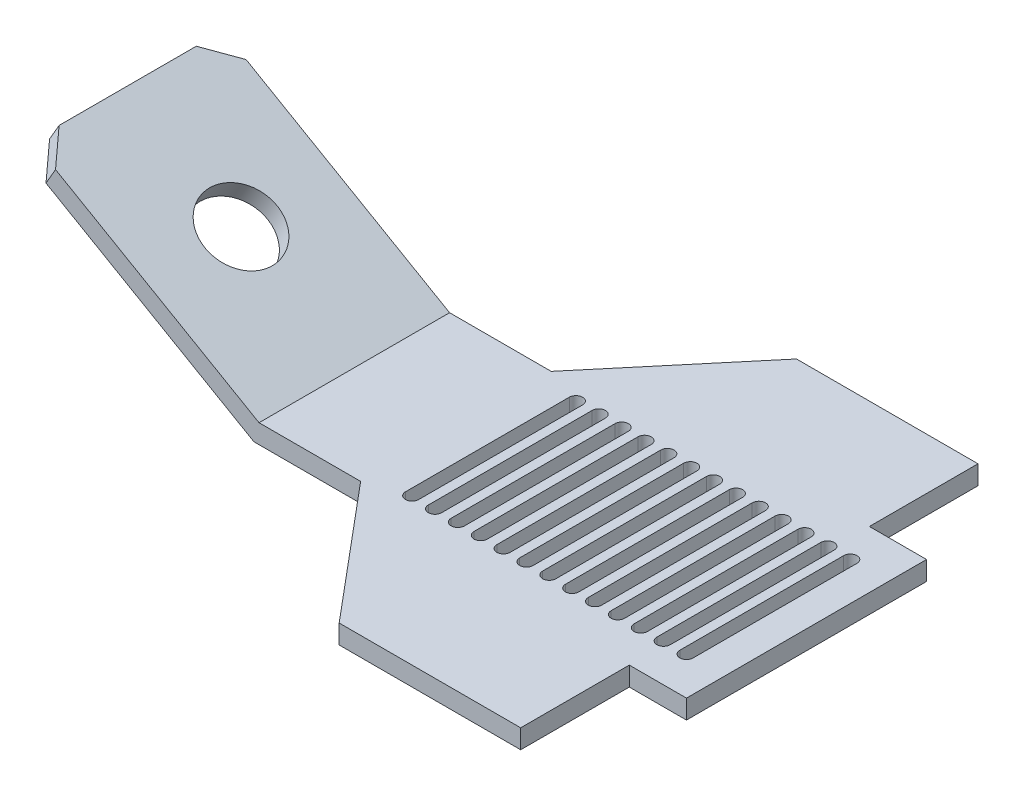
ISO-10303-21;
HEADER;
FILE_DESCRIPTION(('STEP AP214'),'2;1');
FILE_NAME('part.step','',(''),(''),'','','');
FILE_SCHEMA(('AUTOMOTIVE_DESIGN { 1 0 10303 214 1 1 1 1 }'));
ENDSEC;
DATA;
#1=APPLICATION_CONTEXT('core data for automotive mechanical design processes');
#2=APPLICATION_PROTOCOL_DEFINITION('international standard','automotive_design',2000,#1);
#3=PRODUCT_CONTEXT('',#1,'mechanical');
#4=PRODUCT('Part','Part','',(#3));
#5=PRODUCT_RELATED_PRODUCT_CATEGORY('part','',(#4));
#6=PRODUCT_DEFINITION_FORMATION('','',#4);
#7=PRODUCT_DEFINITION_CONTEXT('part definition',#1,'design');
#8=PRODUCT_DEFINITION('design','',#6,#7);
#9=PRODUCT_DEFINITION_SHAPE('','',#8);
#10=(LENGTH_UNIT() NAMED_UNIT(*) SI_UNIT(.MILLI.,.METRE.));
#11=(NAMED_UNIT(*) PLANE_ANGLE_UNIT() SI_UNIT($,.RADIAN.));
#12=(NAMED_UNIT(*) SI_UNIT($,.STERADIAN.) SOLID_ANGLE_UNIT());
#13=UNCERTAINTY_MEASURE_WITH_UNIT(LENGTH_MEASURE(1.E-05),#10,'distance_accuracy_value','');
#14=(GEOMETRIC_REPRESENTATION_CONTEXT(3) GLOBAL_UNCERTAINTY_ASSIGNED_CONTEXT((#13)) GLOBAL_UNIT_ASSIGNED_CONTEXT((#10,
#11,#12)) REPRESENTATION_CONTEXT('',''));
#15=CARTESIAN_POINT('',(0.,0.,0.));
#16=DIRECTION('',(0.,0.,1.));
#17=DIRECTION('',(1.,0.,0.));
#18=AXIS2_PLACEMENT_3D('',#15,#16,#17);
#19=CARTESIAN_POINT('',(-15.0000000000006,5.,31.5009501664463));
#20=DIRECTION('',(0.,1.,0.));
#21=DIRECTION('',(0.,0.,1.));
#22=AXIS2_PLACEMENT_3D('',#19,#20,#21);
#23=PLANE('',#22);
#24=CARTESIAN_POINT('',(-16.,5.,21.5009501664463));
#25=DIRECTION('',(0.,1.,0.));
#26=DIRECTION('',(0.,0.,1.));
#27=AXIS2_PLACEMENT_3D('',#24,#25,#26);
#28=CIRCLE('',#27,1.75);
#29=CARTESIAN_POINT('',(-17.75,5.,21.5009501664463));
#30=VERTEX_POINT('',#29);
#31=CARTESIAN_POINT('',(-14.25,5.,21.5009501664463));
#32=VERTEX_POINT('',#31);
#33=EDGE_CURVE('E501',#30,#32,#28,.T.);
#34=ORIENTED_EDGE('',*,*,#33,.F.);
#35=DIRECTION('',(0.,0.,1.));
#36=VECTOR('',#35,1.);
#37=CARTESIAN_POINT('',(-17.75,5.,21.5009501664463));
#38=LINE('',#37,#36);
#39=CARTESIAN_POINT('',(-17.75,5.,-21.5009501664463));
#40=VERTEX_POINT('',#39);
#41=EDGE_CURVE('E487',#40,#30,#38,.T.);
#42=ORIENTED_EDGE('',*,*,#41,.F.);
#43=CARTESIAN_POINT('',(-16.,5.,-21.5009501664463));
#44=DIRECTION('',(0.,1.,0.));
#45=DIRECTION('',(0.,0.,1.));
#46=AXIS2_PLACEMENT_3D('',#43,#44,#45);
#47=CIRCLE('',#46,1.75);
#48=CARTESIAN_POINT('',(-14.25,5.,-21.5009501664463));
#49=VERTEX_POINT('',#48);
#50=EDGE_CURVE('E480',#49,#40,#47,.T.);
#51=ORIENTED_EDGE('',*,*,#50,.F.);
#52=DIRECTION('',(0.,0.,-1.));
#53=VECTOR('',#52,1.);
#54=CARTESIAN_POINT('',(-14.25,5.,21.5009501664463));
#55=LINE('',#54,#53);
#56=EDGE_CURVE('E465',#32,#49,#55,.T.);
#57=ORIENTED_EDGE('',*,*,#56,.F.);
#58=EDGE_LOOP('',(#34,#42,#51,#57));
#59=FACE_BOUND('',#58,.T.);
#60=CARTESIAN_POINT('',(-10.,5.,21.5009501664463));
#61=DIRECTION('',(0.,1.,0.));
#62=DIRECTION('',(0.,0.,1.));
#63=AXIS2_PLACEMENT_3D('',#60,#61,#62);
#64=CIRCLE('',#63,1.75);
#65=CARTESIAN_POINT('',(-11.75,5.,21.5009501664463));
#66=VERTEX_POINT('',#65);
#67=CARTESIAN_POINT('',(-8.25,5.,21.5009501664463));
#68=VERTEX_POINT('',#67);
#69=EDGE_CURVE('E506',#66,#68,#64,.T.);
#70=ORIENTED_EDGE('',*,*,#69,.F.);
#71=DIRECTION('',(0.,0.,1.));
#72=VECTOR('',#71,1.);
#73=CARTESIAN_POINT('',(-11.75,5.,21.5009501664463));
#74=LINE('',#73,#72);
#75=CARTESIAN_POINT('',(-11.75,5.,-21.5009501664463));
#76=VERTEX_POINT('',#75);
#77=EDGE_CURVE('E511',#76,#66,#74,.T.);
#78=ORIENTED_EDGE('',*,*,#77,.F.);
#79=CARTESIAN_POINT('',(-9.99999999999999,5.,-21.5009501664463));
#80=DIRECTION('',(0.,1.,0.));
#81=DIRECTION('',(0.,0.,1.));
#82=AXIS2_PLACEMENT_3D('',#79,#80,#81);
#83=CIRCLE('',#82,1.75);
#84=CARTESIAN_POINT('',(-8.24999999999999,5.,-21.5009501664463));
#85=VERTEX_POINT('',#84);
#86=EDGE_CURVE('E525',#85,#76,#83,.T.);
#87=ORIENTED_EDGE('',*,*,#86,.F.);
#88=DIRECTION('',(0.,0.,-1.));
#89=VECTOR('',#88,1.);
#90=CARTESIAN_POINT('',(-8.25,5.,21.5009501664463));
#91=LINE('',#90,#89);
#92=EDGE_CURVE('E522',#68,#85,#91,.T.);
#93=ORIENTED_EDGE('',*,*,#92,.F.);
#94=EDGE_LOOP('',(#70,#78,#87,#93));
#95=FACE_BOUND('',#94,.T.);
#96=DIRECTION('',(-1.,0.,0.));
#97=VECTOR('',#96,1.);
#98=CARTESIAN_POINT('',(-92.,5.,-24.9999999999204));
#99=LINE('',#98,#97);
#100=CARTESIAN_POINT('',(-92.,5.,-24.9999999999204));
#101=VERTEX_POINT('',#100);
#102=CARTESIAN_POINT('',(-118.660254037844,5.,-24.9999999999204));
#103=VERTEX_POINT('',#102);
#104=EDGE_CURVE('E566',#101,#103,#99,.T.);
#105=ORIENTED_EDGE('',*,*,#104,.T.);
#106=DIRECTION('',(0.,0.,1.));
#107=VECTOR('',#106,1.);
#108=CARTESIAN_POINT('',(-118.660254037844,5.,31.5009501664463));
#109=LINE('',#108,#107);
#110=CARTESIAN_POINT('',(-118.660254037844,5.,24.9999999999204));
#111=VERTEX_POINT('',#110);
#112=EDGE_CURVE('E631',#103,#111,#109,.T.);
#113=ORIENTED_EDGE('',*,*,#112,.T.);
#114=DIRECTION('',(1.,0.,0.));
#115=VECTOR('',#114,1.);
#116=CARTESIAN_POINT('',(-92.,5.,24.9999999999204));
#117=LINE('',#116,#115);
#118=CARTESIAN_POINT('',(-92.,5.,24.9999999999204));
#119=VERTEX_POINT('',#118);
#120=EDGE_CURVE('E569',#111,#119,#117,.T.);
#121=ORIENTED_EDGE('',*,*,#120,.T.);
#122=DIRECTION('',(0.642787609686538,0.,0.766044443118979));
#123=VECTOR('',#122,1.);
#124=CARTESIAN_POINT('',(-62.6315129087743,5.,59.9999999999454));
#125=LINE('',#124,#123);
#126=CARTESIAN_POINT('',(-62.6315129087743,5.,59.9999999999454));
#127=VERTEX_POINT('',#126);
#128=EDGE_CURVE('E571',#119,#127,#125,.T.);
#129=ORIENTED_EDGE('',*,*,#128,.T.);
#130=DIRECTION('',(1.,0.,0.));
#131=VECTOR('',#130,1.);
#132=CARTESIAN_POINT('',(-15.0000000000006,5.,59.9999999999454));
#133=LINE('',#132,#131);
#134=CARTESIAN_POINT('',(-15.0000000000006,5.,59.9999999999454));
#135=VERTEX_POINT('',#134);
#136=EDGE_CURVE('E573',#127,#135,#133,.T.);
#137=ORIENTED_EDGE('',*,*,#136,.T.);
#138=DIRECTION('',(0.,0.,-1.));
#139=VECTOR('',#138,1.);
#140=CARTESIAN_POINT('',(-15.0000000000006,5.,31.5009501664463));
#141=LINE('',#140,#139);
#142=CARTESIAN_POINT('',(-15.0000000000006,5.,31.5009501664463));
#143=VERTEX_POINT('',#142);
#144=EDGE_CURVE('E575',#135,#143,#141,.T.);
#145=ORIENTED_EDGE('',*,*,#144,.T.);
#146=DIRECTION('',(1.,0.,0.));
#147=VECTOR('',#146,1.);
#148=CARTESIAN_POINT('',(0.,5.,31.5009501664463));
#149=LINE('',#148,#147);
#150=CARTESIAN_POINT('',(0.,5.,31.5009501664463));
#151=VERTEX_POINT('',#150);
#152=EDGE_CURVE('E552',#143,#151,#149,.T.);
#153=ORIENTED_EDGE('',*,*,#152,.T.);
#154=DIRECTION('',(0.,0.,-1.));
#155=VECTOR('',#154,1.);
#156=CARTESIAN_POINT('',(0.,5.,31.5009501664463));
#157=LINE('',#156,#155);
#158=CARTESIAN_POINT('',(0.,5.,-31.5009501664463));
#159=VERTEX_POINT('',#158);
#160=EDGE_CURVE('E555',#151,#159,#157,.T.);
#161=ORIENTED_EDGE('',*,*,#160,.T.);
#162=DIRECTION('',(-1.,0.,0.));
#163=VECTOR('',#162,1.);
#164=CARTESIAN_POINT('',(0.,5.,-31.5009501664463));
#165=LINE('',#164,#163);
#166=CARTESIAN_POINT('',(-15.0000000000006,5.,-31.5009501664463));
#167=VERTEX_POINT('',#166);
#168=EDGE_CURVE('E558',#159,#167,#165,.T.);
#169=ORIENTED_EDGE('',*,*,#168,.T.);
#170=DIRECTION('',(0.,0.,-1.));
#171=VECTOR('',#170,1.);
#172=CARTESIAN_POINT('',(-15.0000000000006,5.,-31.5009501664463));
#173=LINE('',#172,#171);
#174=CARTESIAN_POINT('',(-15.0000000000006,5.,-59.9999999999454));
#175=VERTEX_POINT('',#174);
#176=EDGE_CURVE('E560',#167,#175,#173,.T.);
#177=ORIENTED_EDGE('',*,*,#176,.T.);
#178=DIRECTION('',(-1.,0.,0.));
#179=VECTOR('',#178,1.);
#180=CARTESIAN_POINT('',(-15.0000000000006,5.,-59.9999999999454));
#181=LINE('',#180,#179);
#182=CARTESIAN_POINT('',(-62.6315129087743,5.,-59.9999999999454));
#183=VERTEX_POINT('',#182);
#184=EDGE_CURVE('E562',#175,#183,#181,.T.);
#185=ORIENTED_EDGE('',*,*,#184,.T.);
#186=DIRECTION('',(-0.642787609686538,0.,0.766044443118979));
#187=VECTOR('',#186,1.);
#188=CARTESIAN_POINT('',(-62.6315129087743,5.,-59.9999999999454));
#189=LINE('',#188,#187);
#190=EDGE_CURVE('E564',#183,#101,#189,.T.);
#191=ORIENTED_EDGE('',*,*,#190,.T.);
#192=EDGE_LOOP('',(#105,#113,#121,#129,#137,#145,#153,#161,#169,#177,#185,#191));
#193=FACE_BOUND('',#192,.T.);
#194=CARTESIAN_POINT('',(-22.,5.,21.5009501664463));
#195=DIRECTION('',(0.,1.,0.));
#196=DIRECTION('',(0.,0.,1.));
#197=AXIS2_PLACEMENT_3D('',#194,#195,#196);
#198=CIRCLE('',#197,1.75);
#199=CARTESIAN_POINT('',(-23.75,5.,21.5009501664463));
#200=VERTEX_POINT('',#199);
#201=CARTESIAN_POINT('',(-20.25,5.,21.5009501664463));
#202=VERTEX_POINT('',#201);
#203=EDGE_CURVE('E634',#200,#202,#198,.T.);
#204=ORIENTED_EDGE('',*,*,#203,.F.);
#205=DIRECTION('',(0.,0.,1.));
#206=VECTOR('',#205,1.);
#207=CARTESIAN_POINT('',(-23.75,5.,21.5009501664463));
#208=LINE('',#207,#206);
#209=CARTESIAN_POINT('',(-23.75,5.,-21.5009501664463));
#210=VERTEX_POINT('',#209);
#211=EDGE_CURVE('E636',#210,#200,#208,.T.);
#212=ORIENTED_EDGE('',*,*,#211,.F.);
#213=CARTESIAN_POINT('',(-22.,5.,-21.5009501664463));
#214=DIRECTION('',(0.,1.,0.));
#215=DIRECTION('',(0.,0.,1.));
#216=AXIS2_PLACEMENT_3D('',#213,#214,#215);
#217=CIRCLE('',#216,1.75);
#218=CARTESIAN_POINT('',(-20.25,5.,-21.5009501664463));
#219=VERTEX_POINT('',#218);
#220=EDGE_CURVE('E640',#219,#210,#217,.T.);
#221=ORIENTED_EDGE('',*,*,#220,.F.);
#222=DIRECTION('',(0.,0.,-1.));
#223=VECTOR('',#222,1.);
#224=CARTESIAN_POINT('',(-20.25,5.,21.5009501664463));
#225=LINE('',#224,#223);
#226=EDGE_CURVE('E643',#202,#219,#225,.T.);
#227=ORIENTED_EDGE('',*,*,#226,.F.);
#228=EDGE_LOOP('',(#204,#212,#221,#227));
#229=FACE_BOUND('',#228,.T.);
#230=CARTESIAN_POINT('',(-28.,5.,21.5009501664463));
#231=DIRECTION('',(0.,1.,0.));
#232=DIRECTION('',(0.,0.,1.));
#233=AXIS2_PLACEMENT_3D('',#230,#231,#232);
#234=CIRCLE('',#233,1.75);
#235=CARTESIAN_POINT('',(-29.75,5.,21.5009501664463));
#236=VERTEX_POINT('',#235);
#237=CARTESIAN_POINT('',(-26.25,5.,21.5009501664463));
#238=VERTEX_POINT('',#237);
#239=EDGE_CURVE('E667',#236,#238,#234,.T.);
#240=ORIENTED_EDGE('',*,*,#239,.F.);
#241=DIRECTION('',(0.,0.,1.));
#242=VECTOR('',#241,1.);
#243=CARTESIAN_POINT('',(-29.75,5.,21.5009501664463));
#244=LINE('',#243,#242);
#245=CARTESIAN_POINT('',(-29.75,5.,-21.5009501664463));
#246=VERTEX_POINT('',#245);
#247=EDGE_CURVE('E669',#246,#236,#244,.T.);
#248=ORIENTED_EDGE('',*,*,#247,.F.);
#249=CARTESIAN_POINT('',(-28.,5.,-21.5009501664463));
#250=DIRECTION('',(0.,1.,0.));
#251=DIRECTION('',(0.,0.,1.));
#252=AXIS2_PLACEMENT_3D('',#249,#250,#251);
#253=CIRCLE('',#252,1.75);
#254=CARTESIAN_POINT('',(-26.25,5.,-21.5009501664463));
#255=VERTEX_POINT('',#254);
#256=EDGE_CURVE('E673',#255,#246,#253,.T.);
#257=ORIENTED_EDGE('',*,*,#256,.F.);
#258=DIRECTION('',(0.,0.,-1.));
#259=VECTOR('',#258,1.);
#260=CARTESIAN_POINT('',(-26.25,5.,21.5009501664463));
#261=LINE('',#260,#259);
#262=EDGE_CURVE('E676',#238,#255,#261,.T.);
#263=ORIENTED_EDGE('',*,*,#262,.F.);
#264=EDGE_LOOP('',(#240,#248,#257,#263));
#265=FACE_BOUND('',#264,.T.);
#266=CARTESIAN_POINT('',(-34.,5.,21.5009501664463));
#267=DIRECTION('',(0.,1.,0.));
#268=DIRECTION('',(0.,0.,1.));
#269=AXIS2_PLACEMENT_3D('',#266,#267,#268);
#270=CIRCLE('',#269,1.75);
#271=CARTESIAN_POINT('',(-35.75,5.,21.5009501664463));
#272=VERTEX_POINT('',#271);
#273=CARTESIAN_POINT('',(-32.25,5.,21.5009501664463));
#274=VERTEX_POINT('',#273);
#275=EDGE_CURVE('E703',#272,#274,#270,.T.);
#276=ORIENTED_EDGE('',*,*,#275,.F.);
#277=DIRECTION('',(0.,0.,1.));
#278=VECTOR('',#277,1.);
#279=CARTESIAN_POINT('',(-35.75,5.,21.5009501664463));
#280=LINE('',#279,#278);
#281=CARTESIAN_POINT('',(-35.75,5.,-21.5009501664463));
#282=VERTEX_POINT('',#281);
#283=EDGE_CURVE('E705',#282,#272,#280,.T.);
#284=ORIENTED_EDGE('',*,*,#283,.F.);
#285=CARTESIAN_POINT('',(-34.,5.,-21.5009501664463));
#286=DIRECTION('',(0.,1.,0.));
#287=DIRECTION('',(0.,0.,1.));
#288=AXIS2_PLACEMENT_3D('',#285,#286,#287);
#289=CIRCLE('',#288,1.75);
#290=CARTESIAN_POINT('',(-32.25,5.,-21.5009501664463));
#291=VERTEX_POINT('',#290);
#292=EDGE_CURVE('E709',#291,#282,#289,.T.);
#293=ORIENTED_EDGE('',*,*,#292,.F.);
#294=DIRECTION('',(0.,0.,-1.));
#295=VECTOR('',#294,1.);
#296=CARTESIAN_POINT('',(-32.25,5.,21.5009501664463));
#297=LINE('',#296,#295);
#298=EDGE_CURVE('E712',#274,#291,#297,.T.);
#299=ORIENTED_EDGE('',*,*,#298,.F.);
#300=EDGE_LOOP('',(#276,#284,#293,#299));
#301=FACE_BOUND('',#300,.T.);
#302=CARTESIAN_POINT('',(-40.,5.,21.5009501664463));
#303=DIRECTION('',(0.,1.,0.));
#304=DIRECTION('',(0.,0.,1.));
#305=AXIS2_PLACEMENT_3D('',#302,#303,#304);
#306=CIRCLE('',#305,1.75);
#307=CARTESIAN_POINT('',(-41.75,5.,21.5009501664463));
#308=VERTEX_POINT('',#307);
#309=CARTESIAN_POINT('',(-38.25,5.,21.5009501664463));
#310=VERTEX_POINT('',#309);
#311=EDGE_CURVE('E739',#308,#310,#306,.T.);
#312=ORIENTED_EDGE('',*,*,#311,.F.);
#313=DIRECTION('',(0.,0.,1.));
#314=VECTOR('',#313,1.);
#315=CARTESIAN_POINT('',(-41.75,5.,21.5009501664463));
#316=LINE('',#315,#314);
#317=CARTESIAN_POINT('',(-41.75,5.,-21.5009501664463));
#318=VERTEX_POINT('',#317);
#319=EDGE_CURVE('E741',#318,#308,#316,.T.);
#320=ORIENTED_EDGE('',*,*,#319,.F.);
#321=CARTESIAN_POINT('',(-40.,5.,-21.5009501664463));
#322=DIRECTION('',(0.,1.,0.));
#323=DIRECTION('',(0.,0.,1.));
#324=AXIS2_PLACEMENT_3D('',#321,#322,#323);
#325=CIRCLE('',#324,1.75);
#326=CARTESIAN_POINT('',(-38.25,5.,-21.5009501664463));
#327=VERTEX_POINT('',#326);
#328=EDGE_CURVE('E745',#327,#318,#325,.T.);
#329=ORIENTED_EDGE('',*,*,#328,.F.);
#330=DIRECTION('',(0.,0.,-1.));
#331=VECTOR('',#330,1.);
#332=CARTESIAN_POINT('',(-38.25,5.,21.5009501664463));
#333=LINE('',#332,#331);
#334=EDGE_CURVE('E748',#310,#327,#333,.T.);
#335=ORIENTED_EDGE('',*,*,#334,.F.);
#336=EDGE_LOOP('',(#312,#320,#329,#335));
#337=FACE_BOUND('',#336,.T.);
#338=CARTESIAN_POINT('',(-46.,5.,21.5009501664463));
#339=DIRECTION('',(0.,1.,0.));
#340=DIRECTION('',(0.,0.,1.));
#341=AXIS2_PLACEMENT_3D('',#338,#339,#340);
#342=CIRCLE('',#341,1.75);
#343=CARTESIAN_POINT('',(-47.75,5.,21.5009501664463));
#344=VERTEX_POINT('',#343);
#345=CARTESIAN_POINT('',(-44.25,5.,21.5009501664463));
#346=VERTEX_POINT('',#345);
#347=EDGE_CURVE('E775',#344,#346,#342,.T.);
#348=ORIENTED_EDGE('',*,*,#347,.F.);
#349=DIRECTION('',(0.,0.,1.));
#350=VECTOR('',#349,1.);
#351=CARTESIAN_POINT('',(-47.75,5.,21.5009501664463));
#352=LINE('',#351,#350);
#353=CARTESIAN_POINT('',(-47.75,5.,-21.5009501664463));
#354=VERTEX_POINT('',#353);
#355=EDGE_CURVE('E777',#354,#344,#352,.T.);
#356=ORIENTED_EDGE('',*,*,#355,.F.);
#357=CARTESIAN_POINT('',(-46.,5.,-21.5009501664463));
#358=DIRECTION('',(0.,1.,0.));
#359=DIRECTION('',(0.,0.,1.));
#360=AXIS2_PLACEMENT_3D('',#357,#358,#359);
#361=CIRCLE('',#360,1.75);
#362=CARTESIAN_POINT('',(-44.25,5.,-21.5009501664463));
#363=VERTEX_POINT('',#362);
#364=EDGE_CURVE('E780',#363,#354,#361,.T.);
#365=ORIENTED_EDGE('',*,*,#364,.F.);
#366=DIRECTION('',(0.,0.,-1.));
#367=VECTOR('',#366,1.);
#368=CARTESIAN_POINT('',(-44.25,5.,21.5009501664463));
#369=LINE('',#368,#367);
#370=EDGE_CURVE('E783',#346,#363,#369,.T.);
#371=ORIENTED_EDGE('',*,*,#370,.F.);
#372=EDGE_LOOP('',(#348,#356,#365,#371));
#373=FACE_BOUND('',#372,.T.);
#374=CARTESIAN_POINT('',(-52.,5.,21.5009501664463));
#375=DIRECTION('',(0.,1.,0.));
#376=DIRECTION('',(0.,0.,1.));
#377=AXIS2_PLACEMENT_3D('',#374,#375,#376);
#378=CIRCLE('',#377,1.75);
#379=CARTESIAN_POINT('',(-53.75,5.,21.5009501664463));
#380=VERTEX_POINT('',#379);
#381=CARTESIAN_POINT('',(-50.25,5.,21.5009501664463));
#382=VERTEX_POINT('',#381);
#383=EDGE_CURVE('E809',#380,#382,#378,.T.);
#384=ORIENTED_EDGE('',*,*,#383,.F.);
#385=DIRECTION('',(0.,0.,1.));
#386=VECTOR('',#385,1.);
#387=CARTESIAN_POINT('',(-53.75,5.,21.5009501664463));
#388=LINE('',#387,#386);
#389=CARTESIAN_POINT('',(-53.75,5.,-21.5009501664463));
#390=VERTEX_POINT('',#389);
#391=EDGE_CURVE('E811',#390,#380,#388,.T.);
#392=ORIENTED_EDGE('',*,*,#391,.F.);
#393=CARTESIAN_POINT('',(-52.,5.,-21.5009501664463));
#394=DIRECTION('',(0.,1.,0.));
#395=DIRECTION('',(0.,0.,1.));
#396=AXIS2_PLACEMENT_3D('',#393,#394,#395);
#397=CIRCLE('',#396,1.75);
#398=CARTESIAN_POINT('',(-50.25,5.,-21.5009501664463));
#399=VERTEX_POINT('',#398);
#400=EDGE_CURVE('E814',#399,#390,#397,.T.);
#401=ORIENTED_EDGE('',*,*,#400,.F.);
#402=DIRECTION('',(0.,0.,-1.));
#403=VECTOR('',#402,1.);
#404=CARTESIAN_POINT('',(-50.25,5.,21.5009501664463));
#405=LINE('',#404,#403);
#406=EDGE_CURVE('E817',#382,#399,#405,.T.);
#407=ORIENTED_EDGE('',*,*,#406,.F.);
#408=EDGE_LOOP('',(#384,#392,#401,#407));
#409=FACE_BOUND('',#408,.T.);
#410=CARTESIAN_POINT('',(-58.,5.,21.5009501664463));
#411=DIRECTION('',(0.,1.,0.));
#412=DIRECTION('',(0.,0.,1.));
#413=AXIS2_PLACEMENT_3D('',#410,#411,#412);
#414=CIRCLE('',#413,1.75);
#415=CARTESIAN_POINT('',(-59.75,5.,21.5009501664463));
#416=VERTEX_POINT('',#415);
#417=CARTESIAN_POINT('',(-56.25,5.,21.5009501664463));
#418=VERTEX_POINT('',#417);
#419=EDGE_CURVE('E841',#416,#418,#414,.T.);
#420=ORIENTED_EDGE('',*,*,#419,.F.);
#421=DIRECTION('',(0.,0.,1.));
#422=VECTOR('',#421,1.);
#423=CARTESIAN_POINT('',(-59.75,5.,21.5009501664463));
#424=LINE('',#423,#422);
#425=CARTESIAN_POINT('',(-59.75,5.,-21.5009501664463));
#426=VERTEX_POINT('',#425);
#427=EDGE_CURVE('E843',#426,#416,#424,.T.);
#428=ORIENTED_EDGE('',*,*,#427,.F.);
#429=CARTESIAN_POINT('',(-58.,5.,-21.5009501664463));
#430=DIRECTION('',(0.,1.,0.));
#431=DIRECTION('',(0.,0.,1.));
#432=AXIS2_PLACEMENT_3D('',#429,#430,#431);
#433=CIRCLE('',#432,1.75);
#434=CARTESIAN_POINT('',(-56.25,5.,-21.5009501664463));
#435=VERTEX_POINT('',#434);
#436=EDGE_CURVE('E846',#435,#426,#433,.T.);
#437=ORIENTED_EDGE('',*,*,#436,.F.);
#438=DIRECTION('',(0.,0.,-1.));
#439=VECTOR('',#438,1.);
#440=CARTESIAN_POINT('',(-56.25,5.,21.5009501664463));
#441=LINE('',#440,#439);
#442=EDGE_CURVE('E849',#418,#435,#441,.T.);
#443=ORIENTED_EDGE('',*,*,#442,.F.);
#444=EDGE_LOOP('',(#420,#428,#437,#443));
#445=FACE_BOUND('',#444,.T.);
#446=CARTESIAN_POINT('',(-64.,5.,21.5009501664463));
#447=DIRECTION('',(0.,1.,0.));
#448=DIRECTION('',(0.,0.,1.));
#449=AXIS2_PLACEMENT_3D('',#446,#447,#448);
#450=CIRCLE('',#449,1.75);
#451=CARTESIAN_POINT('',(-65.75,5.,21.5009501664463));
#452=VERTEX_POINT('',#451);
#453=CARTESIAN_POINT('',(-62.25,5.,21.5009501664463));
#454=VERTEX_POINT('',#453);
#455=EDGE_CURVE('E873',#452,#454,#450,.T.);
#456=ORIENTED_EDGE('',*,*,#455,.F.);
#457=DIRECTION('',(0.,0.,1.));
#458=VECTOR('',#457,1.);
#459=CARTESIAN_POINT('',(-65.75,5.,21.5009501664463));
#460=LINE('',#459,#458);
#461=CARTESIAN_POINT('',(-65.75,5.,-21.5009501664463));
#462=VERTEX_POINT('',#461);
#463=EDGE_CURVE('E875',#462,#452,#460,.T.);
#464=ORIENTED_EDGE('',*,*,#463,.F.);
#465=CARTESIAN_POINT('',(-64.,5.,-21.5009501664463));
#466=DIRECTION('',(0.,1.,0.));
#467=DIRECTION('',(0.,0.,1.));
#468=AXIS2_PLACEMENT_3D('',#465,#466,#467);
#469=CIRCLE('',#468,1.75);
#470=CARTESIAN_POINT('',(-62.25,5.,-21.5009501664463));
#471=VERTEX_POINT('',#470);
#472=EDGE_CURVE('E878',#471,#462,#469,.T.);
#473=ORIENTED_EDGE('',*,*,#472,.F.);
#474=DIRECTION('',(0.,0.,-1.));
#475=VECTOR('',#474,1.);
#476=CARTESIAN_POINT('',(-62.25,5.,21.5009501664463));
#477=LINE('',#476,#475);
#478=EDGE_CURVE('E881',#454,#471,#477,.T.);
#479=ORIENTED_EDGE('',*,*,#478,.F.);
#480=EDGE_LOOP('',(#456,#464,#473,#479));
#481=FACE_BOUND('',#480,.T.);
#482=CARTESIAN_POINT('',(-70.,5.,21.5009501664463));
#483=DIRECTION('',(0.,1.,0.));
#484=DIRECTION('',(0.,0.,1.));
#485=AXIS2_PLACEMENT_3D('',#482,#483,#484);
#486=CIRCLE('',#485,1.75);
#487=CARTESIAN_POINT('',(-71.75,5.,21.5009501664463));
#488=VERTEX_POINT('',#487);
#489=CARTESIAN_POINT('',(-68.25,5.,21.5009501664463));
#490=VERTEX_POINT('',#489);
#491=EDGE_CURVE('E905',#488,#490,#486,.T.);
#492=ORIENTED_EDGE('',*,*,#491,.F.);
#493=DIRECTION('',(0.,0.,1.));
#494=VECTOR('',#493,1.);
#495=CARTESIAN_POINT('',(-71.75,5.,21.5009501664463));
#496=LINE('',#495,#494);
#497=CARTESIAN_POINT('',(-71.75,5.,-21.5009501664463));
#498=VERTEX_POINT('',#497);
#499=EDGE_CURVE('E907',#498,#488,#496,.T.);
#500=ORIENTED_EDGE('',*,*,#499,.F.);
#501=CARTESIAN_POINT('',(-70.,5.,-21.5009501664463));
#502=DIRECTION('',(0.,1.,0.));
#503=DIRECTION('',(0.,0.,1.));
#504=AXIS2_PLACEMENT_3D('',#501,#502,#503);
#505=CIRCLE('',#504,1.75);
#506=CARTESIAN_POINT('',(-68.25,5.,-21.5009501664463));
#507=VERTEX_POINT('',#506);
#508=EDGE_CURVE('E910',#507,#498,#505,.T.);
#509=ORIENTED_EDGE('',*,*,#508,.F.);
#510=DIRECTION('',(0.,0.,-1.));
#511=VECTOR('',#510,1.);
#512=CARTESIAN_POINT('',(-68.25,5.,21.5009501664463));
#513=LINE('',#512,#511);
#514=EDGE_CURVE('E913',#490,#507,#513,.T.);
#515=ORIENTED_EDGE('',*,*,#514,.F.);
#516=EDGE_LOOP('',(#492,#500,#509,#515));
#517=FACE_BOUND('',#516,.T.);
#518=CARTESIAN_POINT('',(-76.,5.,21.5009501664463));
#519=DIRECTION('',(0.,1.,0.));
#520=DIRECTION('',(0.,0.,1.));
#521=AXIS2_PLACEMENT_3D('',#518,#519,#520);
#522=CIRCLE('',#521,1.75);
#523=CARTESIAN_POINT('',(-77.75,5.,21.5009501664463));
#524=VERTEX_POINT('',#523);
#525=CARTESIAN_POINT('',(-74.25,5.,21.5009501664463));
#526=VERTEX_POINT('',#525);
#527=EDGE_CURVE('E937',#524,#526,#522,.T.);
#528=ORIENTED_EDGE('',*,*,#527,.F.);
#529=DIRECTION('',(0.,0.,1.));
#530=VECTOR('',#529,1.);
#531=CARTESIAN_POINT('',(-77.75,5.,21.5009501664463));
#532=LINE('',#531,#530);
#533=CARTESIAN_POINT('',(-77.75,5.,-21.5009501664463));
#534=VERTEX_POINT('',#533);
#535=EDGE_CURVE('E939',#534,#524,#532,.T.);
#536=ORIENTED_EDGE('',*,*,#535,.F.);
#537=CARTESIAN_POINT('',(-76.,5.,-21.5009501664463));
#538=DIRECTION('',(0.,1.,0.));
#539=DIRECTION('',(0.,0.,1.));
#540=AXIS2_PLACEMENT_3D('',#537,#538,#539);
#541=CIRCLE('',#540,1.75);
#542=CARTESIAN_POINT('',(-74.25,5.,-21.5009501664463));
#543=VERTEX_POINT('',#542);
#544=EDGE_CURVE('E942',#543,#534,#541,.T.);
#545=ORIENTED_EDGE('',*,*,#544,.F.);
#546=DIRECTION('',(0.,0.,-1.));
#547=VECTOR('',#546,1.);
#548=CARTESIAN_POINT('',(-74.25,5.,21.5009501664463));
#549=LINE('',#548,#547);
#550=EDGE_CURVE('E945',#526,#543,#549,.T.);
#551=ORIENTED_EDGE('',*,*,#550,.F.);
#552=EDGE_LOOP('',(#528,#536,#545,#551));
#553=FACE_BOUND('',#552,.T.);
#554=CARTESIAN_POINT('',(-82.,5.,21.5009501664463));
#555=DIRECTION('',(0.,1.,0.));
#556=DIRECTION('',(0.,0.,1.));
#557=AXIS2_PLACEMENT_3D('',#554,#555,#556);
#558=CIRCLE('',#557,1.75);
#559=CARTESIAN_POINT('',(-83.75,5.,21.5009501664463));
#560=VERTEX_POINT('',#559);
#561=CARTESIAN_POINT('',(-80.25,5.,21.5009501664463));
#562=VERTEX_POINT('',#561);
#563=EDGE_CURVE('E969',#560,#562,#558,.T.);
#564=ORIENTED_EDGE('',*,*,#563,.F.);
#565=DIRECTION('',(0.,0.,1.));
#566=VECTOR('',#565,1.);
#567=CARTESIAN_POINT('',(-83.75,5.,21.5009501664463));
#568=LINE('',#567,#566);
#569=CARTESIAN_POINT('',(-83.75,5.,-21.5009501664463));
#570=VERTEX_POINT('',#569);
#571=EDGE_CURVE('E971',#570,#560,#568,.T.);
#572=ORIENTED_EDGE('',*,*,#571,.F.);
#573=CARTESIAN_POINT('',(-82.,5.,-21.5009501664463));
#574=DIRECTION('',(0.,1.,0.));
#575=DIRECTION('',(0.,0.,1.));
#576=AXIS2_PLACEMENT_3D('',#573,#574,#575);
#577=CIRCLE('',#576,1.75);
#578=CARTESIAN_POINT('',(-80.25,5.,-21.5009501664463));
#579=VERTEX_POINT('',#578);
#580=EDGE_CURVE('E974',#579,#570,#577,.T.);
#581=ORIENTED_EDGE('',*,*,#580,.F.);
#582=DIRECTION('',(0.,0.,-1.));
#583=VECTOR('',#582,1.);
#584=CARTESIAN_POINT('',(-80.25,5.,21.5009501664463));
#585=LINE('',#584,#583);
#586=EDGE_CURVE('E977',#562,#579,#585,.T.);
#587=ORIENTED_EDGE('',*,*,#586,.F.);
#588=EDGE_LOOP('',(#564,#572,#581,#587));
#589=FACE_BOUND('',#588,.T.);
#590=ADVANCED_FACE('F37',(#59,#95,#193,#229,#265,#301,#337,#373,#409,#445,#481,#517,#553,#589),
#23,.T.);
#591=CARTESIAN_POINT('',(0.,5.,31.5009501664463));
#592=DIRECTION('',(0.,0.,-1.));
#593=DIRECTION('',(-1.,0.,0.));
#594=AXIS2_PLACEMENT_3D('',#591,#592,#593);
#595=PLANE('',#594);
#596=DIRECTION('',(1.,0.,0.));
#597=VECTOR('',#596,1.);
#598=CARTESIAN_POINT('',(0.,0.,31.5009501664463));
#599=LINE('',#598,#597);
#600=CARTESIAN_POINT('',(-15.0000000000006,0.,31.5009501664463));
#601=VERTEX_POINT('',#600);
#602=CARTESIAN_POINT('',(0.,0.,31.5009501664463));
#603=VERTEX_POINT('',#602);
#604=EDGE_CURVE('E546',#601,#603,#599,.T.);
#605=ORIENTED_EDGE('',*,*,#604,.T.);
#606=DIRECTION('',(0.,-1.,0.));
#607=VECTOR('',#606,1.);
#608=CARTESIAN_POINT('',(0.,5.,31.5009501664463));
#609=LINE('',#608,#607);
#610=EDGE_CURVE('E628',#151,#603,#609,.T.);
#611=ORIENTED_EDGE('',*,*,#610,.F.);
#612=ORIENTED_EDGE('',*,*,#152,.F.);
#613=DIRECTION('',(0.,-1.,0.));
#614=VECTOR('',#613,1.);
#615=CARTESIAN_POINT('',(-15.0000000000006,5.,31.5009501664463));
#616=LINE('',#615,#614);
#617=EDGE_CURVE('E577',#143,#601,#616,.T.);
#618=ORIENTED_EDGE('',*,*,#617,.T.);
#619=EDGE_LOOP('',(#605,#611,#612,#618));
#620=FACE_BOUND('',#619,.T.);
#621=ADVANCED_FACE('F1067',(#620),#595,.F.);
#622=CARTESIAN_POINT('',(0.,5.,31.5009501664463));
#623=DIRECTION('',(-1.,0.,0.));
#624=DIRECTION('',(0.,0.,1.));
#625=AXIS2_PLACEMENT_3D('',#622,#623,#624);
#626=PLANE('',#625);
#627=DIRECTION('',(0.,0.,-1.));
#628=VECTOR('',#627,1.);
#629=CARTESIAN_POINT('',(0.,0.,31.5009501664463));
#630=LINE('',#629,#628);
#631=CARTESIAN_POINT('',(0.,0.,-31.5009501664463));
#632=VERTEX_POINT('',#631);
#633=EDGE_CURVE('E580',#603,#632,#630,.T.);
#634=ORIENTED_EDGE('',*,*,#633,.T.);
#635=DIRECTION('',(0.,-1.,0.));
#636=VECTOR('',#635,1.);
#637=CARTESIAN_POINT('',(0.,5.,-31.5009501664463));
#638=LINE('',#637,#636);
#639=EDGE_CURVE('E625',#159,#632,#638,.T.);
#640=ORIENTED_EDGE('',*,*,#639,.F.);
#641=ORIENTED_EDGE('',*,*,#160,.F.);
#642=ORIENTED_EDGE('',*,*,#610,.T.);
#643=EDGE_LOOP('',(#634,#640,#641,#642));
#644=FACE_BOUND('',#643,.T.);
#645=ADVANCED_FACE('F1069',(#644),#626,.F.);
#646=CARTESIAN_POINT('',(0.,5.,-31.5009501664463));
#647=DIRECTION('',(0.,0.,1.));
#648=DIRECTION('',(1.,0.,0.));
#649=AXIS2_PLACEMENT_3D('',#646,#647,#648);
#650=PLANE('',#649);
#651=DIRECTION('',(-1.,0.,0.));
#652=VECTOR('',#651,1.);
#653=CARTESIAN_POINT('',(0.,0.,-31.5009501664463));
#654=LINE('',#653,#652);
#655=CARTESIAN_POINT('',(-15.0000000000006,0.,-31.5009501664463));
#656=VERTEX_POINT('',#655);
#657=EDGE_CURVE('E582',#632,#656,#654,.T.);
#658=ORIENTED_EDGE('',*,*,#657,.T.);
#659=DIRECTION('',(0.,-1.,0.));
#660=VECTOR('',#659,1.);
#661=CARTESIAN_POINT('',(-15.0000000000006,5.,-31.5009501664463));
#662=LINE('',#661,#660);
#663=EDGE_CURVE('E622',#167,#656,#662,.T.);
#664=ORIENTED_EDGE('',*,*,#663,.F.);
#665=ORIENTED_EDGE('',*,*,#168,.F.);
#666=ORIENTED_EDGE('',*,*,#639,.T.);
#667=EDGE_LOOP('',(#658,#664,#665,#666));
#668=FACE_BOUND('',#667,.T.);
#669=ADVANCED_FACE('F1074',(#668),#650,.F.);
#670=CARTESIAN_POINT('',(-15.0000000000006,5.,-31.5009501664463));
#671=DIRECTION('',(-1.,0.,0.));
#672=DIRECTION('',(0.,0.,1.));
#673=AXIS2_PLACEMENT_3D('',#670,#671,#672);
#674=PLANE('',#673);
#675=DIRECTION('',(0.,0.,-1.));
#676=VECTOR('',#675,1.);
#677=CARTESIAN_POINT('',(-15.0000000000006,0.,-31.5009501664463));
#678=LINE('',#677,#676);
#679=CARTESIAN_POINT('',(-15.0000000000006,0.,-59.9999999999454));
#680=VERTEX_POINT('',#679);
#681=EDGE_CURVE('E584',#656,#680,#678,.T.);
#682=ORIENTED_EDGE('',*,*,#681,.T.);
#683=DIRECTION('',(0.,-1.,0.));
#684=VECTOR('',#683,1.);
#685=CARTESIAN_POINT('',(-15.0000000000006,5.,-59.9999999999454));
#686=LINE('',#685,#684);
#687=EDGE_CURVE('E619',#175,#680,#686,.T.);
#688=ORIENTED_EDGE('',*,*,#687,.F.);
#689=ORIENTED_EDGE('',*,*,#176,.F.);
#690=ORIENTED_EDGE('',*,*,#663,.T.);
#691=EDGE_LOOP('',(#682,#688,#689,#690));
#692=FACE_BOUND('',#691,.T.);
#693=ADVANCED_FACE('F1080',(#692),#674,.F.);
#694=CARTESIAN_POINT('',(-15.0000000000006,5.,-59.9999999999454));
#695=DIRECTION('',(0.,0.,1.));
#696=DIRECTION('',(1.,0.,0.));
#697=AXIS2_PLACEMENT_3D('',#694,#695,#696);
#698=PLANE('',#697);
#699=DIRECTION('',(-1.,0.,0.));
#700=VECTOR('',#699,1.);
#701=CARTESIAN_POINT('',(-15.0000000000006,0.,-59.9999999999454));
#702=LINE('',#701,#700);
#703=CARTESIAN_POINT('',(-62.6315129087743,0.,-59.9999999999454));
#704=VERTEX_POINT('',#703);
#705=EDGE_CURVE('E586',#680,#704,#702,.T.);
#706=ORIENTED_EDGE('',*,*,#705,.T.);
#707=DIRECTION('',(0.,-1.,0.));
#708=VECTOR('',#707,1.);
#709=CARTESIAN_POINT('',(-62.6315129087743,5.,-59.9999999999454));
#710=LINE('',#709,#708);
#711=EDGE_CURVE('E616',#183,#704,#710,.T.);
#712=ORIENTED_EDGE('',*,*,#711,.F.);
#713=ORIENTED_EDGE('',*,*,#184,.F.);
#714=ORIENTED_EDGE('',*,*,#687,.T.);
#715=EDGE_LOOP('',(#706,#712,#713,#714));
#716=FACE_BOUND('',#715,.T.);
#717=ADVANCED_FACE('F1083',(#716),#698,.F.);
#718=CARTESIAN_POINT('',(-62.6315129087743,5.,-59.9999999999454));
#719=DIRECTION('',(0.766044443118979,0.,0.642787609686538));
#720=DIRECTION('',(0.642787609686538,0.,-0.766044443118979));
#721=AXIS2_PLACEMENT_3D('',#718,#719,#720);
#722=PLANE('',#721);
#723=DIRECTION('',(-0.642787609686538,0.,0.766044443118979));
#724=VECTOR('',#723,1.);
#725=CARTESIAN_POINT('',(-62.6315129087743,0.,-59.9999999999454));
#726=LINE('',#725,#724);
#727=CARTESIAN_POINT('',(-92.,0.,-24.9999999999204));
#728=VERTEX_POINT('',#727);
#729=EDGE_CURVE('E588',#704,#728,#726,.T.);
#730=ORIENTED_EDGE('',*,*,#729,.T.);
#731=DIRECTION('',(0.,-1.,0.));
#732=VECTOR('',#731,1.);
#733=CARTESIAN_POINT('',(-92.,5.,-24.9999999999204));
#734=LINE('',#733,#732);
#735=EDGE_CURVE('E613',#101,#728,#734,.T.);
#736=ORIENTED_EDGE('',*,*,#735,.F.);
#737=ORIENTED_EDGE('',*,*,#190,.F.);
#738=ORIENTED_EDGE('',*,*,#711,.T.);
#739=EDGE_LOOP('',(#730,#736,#737,#738));
#740=FACE_BOUND('',#739,.T.);
#741=ADVANCED_FACE('F1084',(#740),#722,.F.);
#742=CARTESIAN_POINT('',(-92.,5.,-24.9999999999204));
#743=DIRECTION('',(0.,0.,1.));
#744=DIRECTION('',(1.,0.,0.));
#745=AXIS2_PLACEMENT_3D('',#742,#743,#744);
#746=PLANE('',#745);
#747=DIRECTION('',(-0.866025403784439,0.499999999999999,0.));
#748=VECTOR('',#747,1.);
#749=CARTESIAN_POINT('',(-120.,0.,-24.9999999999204));
#750=LINE('',#749,#748);
#751=CARTESIAN_POINT('',(-120.,0.,-24.9999999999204));
#752=VERTEX_POINT('',#751);
#753=CARTESIAN_POINT('',(-174.559600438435,31.500000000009,-24.9999999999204));
#754=VERTEX_POINT('',#753);
#755=EDGE_CURVE('E532',#752,#754,#750,.T.);
#756=ORIENTED_EDGE('',*,*,#755,.T.);
#757=DIRECTION('',(0.5,0.866025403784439,0.));
#758=VECTOR('',#757,1.);
#759=CARTESIAN_POINT('',(-165.394536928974,47.3743556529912,-24.9999999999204));
#760=LINE('',#759,#758);
#761=CARTESIAN_POINT('',(-172.059600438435,35.8301270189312,-24.9999999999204));
#762=VERTEX_POINT('',#761);
#763=EDGE_CURVE('E1001',#754,#762,#760,.T.);
#764=ORIENTED_EDGE('',*,*,#763,.T.);
#765=DIRECTION('',(0.866025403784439,-0.499999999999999,0.));
#766=VECTOR('',#765,1.);
#767=CARTESIAN_POINT('',(-117.5,4.33012701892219,-24.9999999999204));
#768=LINE('',#767,#766);
#769=EDGE_CURVE('E541',#762,#103,#768,.T.);
#770=ORIENTED_EDGE('',*,*,#769,.T.);
#771=ORIENTED_EDGE('',*,*,#104,.F.);
#772=ORIENTED_EDGE('',*,*,#735,.T.);
#773=DIRECTION('',(-1.,0.,0.));
#774=VECTOR('',#773,1.);
#775=CARTESIAN_POINT('',(-92.,0.,-24.9999999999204));
#776=LINE('',#775,#774);
#777=EDGE_CURVE('E590',#728,#752,#776,.T.);
#778=ORIENTED_EDGE('',*,*,#777,.T.);
#779=EDGE_LOOP('',(#756,#764,#770,#771,#772,#778));
#780=FACE_BOUND('',#779,.T.);
#781=ADVANCED_FACE('F1020',(#780),#746,.F.);
#782=CARTESIAN_POINT('',(-92.,5.,24.9999999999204));
#783=DIRECTION('',(0.,0.,-1.));
#784=DIRECTION('',(-1.,0.,0.));
#785=AXIS2_PLACEMENT_3D('',#782,#783,#784);
#786=PLANE('',#785);
#787=DIRECTION('',(0.866025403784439,-0.499999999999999,0.));
#788=VECTOR('',#787,1.);
#789=CARTESIAN_POINT('',(-117.5,4.33012701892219,24.9999999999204));
#790=LINE('',#789,#788);
#791=CARTESIAN_POINT('',(-172.059600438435,35.8301270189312,24.9999999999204));
#792=VERTEX_POINT('',#791);
#793=EDGE_CURVE('E544',#792,#111,#790,.T.);
#794=ORIENTED_EDGE('',*,*,#793,.F.);
#795=DIRECTION('',(-0.5,-0.866025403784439,0.));
#796=VECTOR('',#795,1.);
#797=CARTESIAN_POINT('',(-165.394536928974,47.3743556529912,24.9999999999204));
#798=LINE('',#797,#796);
#799=CARTESIAN_POINT('',(-174.559600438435,31.500000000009,24.9999999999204));
#800=VERTEX_POINT('',#799);
#801=EDGE_CURVE('E11',#792,#800,#798,.T.);
#802=ORIENTED_EDGE('',*,*,#801,.T.);
#803=DIRECTION('',(-0.866025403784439,0.499999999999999,0.));
#804=VECTOR('',#803,1.);
#805=CARTESIAN_POINT('',(-120.,0.,24.9999999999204));
#806=LINE('',#805,#804);
#807=CARTESIAN_POINT('',(-120.,0.,24.9999999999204));
#808=VERTEX_POINT('',#807);
#809=EDGE_CURVE('E547',#808,#800,#806,.T.);
#810=ORIENTED_EDGE('',*,*,#809,.F.);
#811=DIRECTION('',(1.,0.,0.));
#812=VECTOR('',#811,1.);
#813=CARTESIAN_POINT('',(-92.,0.,24.9999999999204));
#814=LINE('',#813,#812);
#815=CARTESIAN_POINT('',(-92.,0.,24.9999999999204));
#816=VERTEX_POINT('',#815);
#817=EDGE_CURVE('E595',#808,#816,#814,.T.);
#818=ORIENTED_EDGE('',*,*,#817,.T.);
#819=DIRECTION('',(0.,-1.,0.));
#820=VECTOR('',#819,1.);
#821=CARTESIAN_POINT('',(-92.,5.,24.9999999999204));
#822=LINE('',#821,#820);
#823=EDGE_CURVE('E610',#119,#816,#822,.T.);
#824=ORIENTED_EDGE('',*,*,#823,.F.);
#825=ORIENTED_EDGE('',*,*,#120,.F.);
#826=EDGE_LOOP('',(#794,#802,#810,#818,#824,#825));
#827=FACE_BOUND('',#826,.T.);
#828=ADVANCED_FACE('F1034',(#827),#786,.F.);
#829=CARTESIAN_POINT('',(-62.6315129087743,5.,59.9999999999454));
#830=DIRECTION('',(0.766044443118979,0.,-0.642787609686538));
#831=DIRECTION('',(-0.642787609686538,0.,-0.766044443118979));
#832=AXIS2_PLACEMENT_3D('',#829,#830,#831);
#833=PLANE('',#832);
#834=DIRECTION('',(0.642787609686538,0.,0.766044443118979));
#835=VECTOR('',#834,1.);
#836=CARTESIAN_POINT('',(-62.6315129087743,0.,59.9999999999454));
#837=LINE('',#836,#835);
#838=CARTESIAN_POINT('',(-62.6315129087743,0.,59.9999999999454));
#839=VERTEX_POINT('',#838);
#840=EDGE_CURVE('E597',#816,#839,#837,.T.);
#841=ORIENTED_EDGE('',*,*,#840,.T.);
#842=DIRECTION('',(0.,-1.,0.));
#843=VECTOR('',#842,1.);
#844=CARTESIAN_POINT('',(-62.6315129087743,5.,59.9999999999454));
#845=LINE('',#844,#843);
#846=EDGE_CURVE('E607',#127,#839,#845,.T.);
#847=ORIENTED_EDGE('',*,*,#846,.F.);
#848=ORIENTED_EDGE('',*,*,#128,.F.);
#849=ORIENTED_EDGE('',*,*,#823,.T.);
#850=EDGE_LOOP('',(#841,#847,#848,#849));
#851=FACE_BOUND('',#850,.T.);
#852=ADVANCED_FACE('F1052',(#851),#833,.F.);
#853=CARTESIAN_POINT('',(-15.0000000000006,5.,59.9999999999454));
#854=DIRECTION('',(0.,0.,-1.));
#855=DIRECTION('',(-1.,0.,0.));
#856=AXIS2_PLACEMENT_3D('',#853,#854,#855);
#857=PLANE('',#856);
#858=DIRECTION('',(1.,0.,0.));
#859=VECTOR('',#858,1.);
#860=CARTESIAN_POINT('',(-15.0000000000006,0.,59.9999999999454));
#861=LINE('',#860,#859);
#862=CARTESIAN_POINT('',(-15.0000000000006,0.,59.9999999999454));
#863=VERTEX_POINT('',#862);
#864=EDGE_CURVE('E599',#839,#863,#861,.T.);
#865=ORIENTED_EDGE('',*,*,#864,.T.);
#866=DIRECTION('',(0.,-1.,0.));
#867=VECTOR('',#866,1.);
#868=CARTESIAN_POINT('',(-15.0000000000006,5.,59.9999999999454));
#869=LINE('',#868,#867);
#870=EDGE_CURVE('E604',#135,#863,#869,.T.);
#871=ORIENTED_EDGE('',*,*,#870,.F.);
#872=ORIENTED_EDGE('',*,*,#136,.F.);
#873=ORIENTED_EDGE('',*,*,#846,.T.);
#874=EDGE_LOOP('',(#865,#871,#872,#873));
#875=FACE_BOUND('',#874,.T.);
#876=ADVANCED_FACE('F1057',(#875),#857,.F.);
#877=CARTESIAN_POINT('',(-15.0000000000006,5.,31.5009501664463));
#878=DIRECTION('',(-1.,0.,0.));
#879=DIRECTION('',(0.,0.,1.));
#880=AXIS2_PLACEMENT_3D('',#877,#878,#879);
#881=PLANE('',#880);
#882=DIRECTION('',(0.,0.,-1.));
#883=VECTOR('',#882,1.);
#884=CARTESIAN_POINT('',(-15.0000000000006,0.,31.5009501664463));
#885=LINE('',#884,#883);
#886=EDGE_CURVE('E556',#863,#601,#885,.T.);
#887=ORIENTED_EDGE('',*,*,#886,.T.);
#888=ORIENTED_EDGE('',*,*,#617,.F.);
#889=ORIENTED_EDGE('',*,*,#144,.F.);
#890=ORIENTED_EDGE('',*,*,#870,.T.);
#891=EDGE_LOOP('',(#887,#888,#889,#890));
#892=FACE_BOUND('',#891,.T.);
#893=ADVANCED_FACE('F1061',(#892),#881,.F.);
#894=CARTESIAN_POINT('',(-15.0000000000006,0.,31.5009501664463));
#895=DIRECTION('',(0.,1.,0.));
#896=DIRECTION('',(0.,0.,1.));
#897=AXIS2_PLACEMENT_3D('',#894,#895,#896);
#898=PLANE('',#897);
#899=DIRECTION('',(0.,0.,1.));
#900=VECTOR('',#899,1.);
#901=CARTESIAN_POINT('',(-17.75,0.,21.5009501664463));
#902=LINE('',#901,#900);
#903=CARTESIAN_POINT('',(-17.75,0.,-21.5009501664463));
#904=VERTEX_POINT('',#903);
#905=CARTESIAN_POINT('',(-17.75,0.,21.5009501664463));
#906=VERTEX_POINT('',#905);
#907=EDGE_CURVE('E498',#904,#906,#902,.T.);
#908=ORIENTED_EDGE('',*,*,#907,.T.);
#909=CARTESIAN_POINT('',(-16.,0.,21.5009501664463));
#910=DIRECTION('',(0.,1.,0.));
#911=DIRECTION('',(0.,0.,1.));
#912=AXIS2_PLACEMENT_3D('',#909,#910,#911);
#913=CIRCLE('',#912,1.75);
#914=CARTESIAN_POINT('',(-14.25,0.,21.5009501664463));
#915=VERTEX_POINT('',#914);
#916=EDGE_CURVE('E503',#906,#915,#913,.T.);
#917=ORIENTED_EDGE('',*,*,#916,.T.);
#918=DIRECTION('',(0.,0.,-1.));
#919=VECTOR('',#918,1.);
#920=CARTESIAN_POINT('',(-14.25,0.,21.5009501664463));
#921=LINE('',#920,#919);
#922=CARTESIAN_POINT('',(-14.25,0.,-21.5009501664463));
#923=VERTEX_POINT('',#922);
#924=EDGE_CURVE('E475',#915,#923,#921,.T.);
#925=ORIENTED_EDGE('',*,*,#924,.T.);
#926=CARTESIAN_POINT('',(-16.,0.,-21.5009501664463));
#927=DIRECTION('',(0.,1.,0.));
#928=DIRECTION('',(0.,0.,1.));
#929=AXIS2_PLACEMENT_3D('',#926,#927,#928);
#930=CIRCLE('',#929,1.75);
#931=EDGE_CURVE('E483',#923,#904,#930,.T.);
#932=ORIENTED_EDGE('',*,*,#931,.T.);
#933=EDGE_LOOP('',(#908,#917,#925,#932));
#934=FACE_BOUND('',#933,.T.);
#935=DIRECTION('',(0.,0.,1.));
#936=VECTOR('',#935,1.);
#937=CARTESIAN_POINT('',(-11.75,0.,21.5009501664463));
#938=LINE('',#937,#936);
#939=CARTESIAN_POINT('',(-11.75,0.,-21.5009501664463));
#940=VERTEX_POINT('',#939);
#941=CARTESIAN_POINT('',(-11.75,0.,21.5009501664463));
#942=VERTEX_POINT('',#941);
#943=EDGE_CURVE('E517',#940,#942,#938,.T.);
#944=ORIENTED_EDGE('',*,*,#943,.T.);
#945=CARTESIAN_POINT('',(-10.,0.,21.5009501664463));
#946=DIRECTION('',(0.,1.,0.));
#947=DIRECTION('',(0.,0.,1.));
#948=AXIS2_PLACEMENT_3D('',#945,#946,#947);
#949=CIRCLE('',#948,1.75);
#950=CARTESIAN_POINT('',(-8.25,0.,21.5009501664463));
#951=VERTEX_POINT('',#950);
#952=EDGE_CURVE('E507',#942,#951,#949,.T.);
#953=ORIENTED_EDGE('',*,*,#952,.T.);
#954=DIRECTION('',(0.,0.,-1.));
#955=VECTOR('',#954,1.);
#956=CARTESIAN_POINT('',(-8.25,0.,21.5009501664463));
#957=LINE('',#956,#955);
#958=CARTESIAN_POINT('',(-8.25,0.,-21.5009501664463));
#959=VERTEX_POINT('',#958);
#960=EDGE_CURVE('E510',#951,#959,#957,.T.);
#961=ORIENTED_EDGE('',*,*,#960,.T.);
#962=CARTESIAN_POINT('',(-9.99999999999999,0.,-21.5009501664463));
#963=DIRECTION('',(0.,1.,0.));
#964=DIRECTION('',(0.,0.,1.));
#965=AXIS2_PLACEMENT_3D('',#962,#963,#964);
#966=CIRCLE('',#965,1.75);
#967=EDGE_CURVE('E514',#959,#940,#966,.T.);
#968=ORIENTED_EDGE('',*,*,#967,.T.);
#969=EDGE_LOOP('',(#944,#953,#961,#968));
#970=FACE_BOUND('',#969,.T.);
#971=ORIENTED_EDGE('',*,*,#604,.F.);
#972=ORIENTED_EDGE('',*,*,#886,.F.);
#973=ORIENTED_EDGE('',*,*,#864,.F.);
#974=ORIENTED_EDGE('',*,*,#840,.F.);
#975=ORIENTED_EDGE('',*,*,#817,.F.);
#976=DIRECTION('',(0.,0.,1.));
#977=VECTOR('',#976,1.);
#978=CARTESIAN_POINT('',(-120.,0.,-24.9999999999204));
#979=LINE('',#978,#977);
#980=EDGE_CURVE('E592',#752,#808,#979,.T.);
#981=ORIENTED_EDGE('',*,*,#980,.F.);
#982=ORIENTED_EDGE('',*,*,#777,.F.);
#983=ORIENTED_EDGE('',*,*,#729,.F.);
#984=ORIENTED_EDGE('',*,*,#705,.F.);
#985=ORIENTED_EDGE('',*,*,#681,.F.);
#986=ORIENTED_EDGE('',*,*,#657,.F.);
#987=ORIENTED_EDGE('',*,*,#633,.F.);
#988=EDGE_LOOP('',(#971,#972,#973,#974,#975,#981,#982,#983,#984,#985,#986,#987));
#989=FACE_BOUND('',#988,.T.);
#990=CARTESIAN_POINT('',(-22.,0.,21.5009501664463));
#991=DIRECTION('',(0.,1.,0.));
#992=DIRECTION('',(0.,0.,1.));
#993=AXIS2_PLACEMENT_3D('',#990,#991,#992);
#994=CIRCLE('',#993,1.75);
#995=CARTESIAN_POINT('',(-23.75,0.,21.5009501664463));
#996=VERTEX_POINT('',#995);
#997=CARTESIAN_POINT('',(-20.25,0.,21.5009501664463));
#998=VERTEX_POINT('',#997);
#999=EDGE_CURVE('E646',#996,#998,#994,.T.);
#1000=ORIENTED_EDGE('',*,*,#999,.T.);
#1001=DIRECTION('',(0.,0.,-1.));
#1002=VECTOR('',#1001,1.);
#1003=CARTESIAN_POINT('',(-20.25,0.,21.5009501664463));
#1004=LINE('',#1003,#1002);
#1005=CARTESIAN_POINT('',(-20.25,0.,-21.5009501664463));
#1006=VERTEX_POINT('',#1005);
#1007=EDGE_CURVE('E648',#998,#1006,#1004,.T.);
#1008=ORIENTED_EDGE('',*,*,#1007,.T.);
#1009=CARTESIAN_POINT('',(-22.,0.,-21.5009501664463));
#1010=DIRECTION('',(0.,1.,0.));
#1011=DIRECTION('',(0.,0.,1.));
#1012=AXIS2_PLACEMENT_3D('',#1009,#1010,#1011);
#1013=CIRCLE('',#1012,1.75);
#1014=CARTESIAN_POINT('',(-23.75,0.,-21.5009501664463));
#1015=VERTEX_POINT('',#1014);
#1016=EDGE_CURVE('E650',#1006,#1015,#1013,.T.);
#1017=ORIENTED_EDGE('',*,*,#1016,.T.);
#1018=DIRECTION('',(0.,0.,1.));
#1019=VECTOR('',#1018,1.);
#1020=CARTESIAN_POINT('',(-23.75,0.,21.5009501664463));
#1021=LINE('',#1020,#1019);
#1022=EDGE_CURVE('E652',#1015,#996,#1021,.T.);
#1023=ORIENTED_EDGE('',*,*,#1022,.T.);
#1024=EDGE_LOOP('',(#1000,#1008,#1017,#1023));
#1025=FACE_BOUND('',#1024,.T.);
#1026=CARTESIAN_POINT('',(-28.,0.,21.5009501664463));
#1027=DIRECTION('',(0.,1.,0.));
#1028=DIRECTION('',(0.,0.,1.));
#1029=AXIS2_PLACEMENT_3D('',#1026,#1027,#1028);
#1030=CIRCLE('',#1029,1.75);
#1031=CARTESIAN_POINT('',(-29.75,0.,21.5009501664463));
#1032=VERTEX_POINT('',#1031);
#1033=CARTESIAN_POINT('',(-26.25,0.,21.5009501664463));
#1034=VERTEX_POINT('',#1033);
#1035=EDGE_CURVE('E680',#1032,#1034,#1030,.T.);
#1036=ORIENTED_EDGE('',*,*,#1035,.T.);
#1037=DIRECTION('',(0.,0.,-1.));
#1038=VECTOR('',#1037,1.);
#1039=CARTESIAN_POINT('',(-26.25,0.,21.5009501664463));
#1040=LINE('',#1039,#1038);
#1041=CARTESIAN_POINT('',(-26.25,0.,-21.5009501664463));
#1042=VERTEX_POINT('',#1041);
#1043=EDGE_CURVE('E682',#1034,#1042,#1040,.T.);
#1044=ORIENTED_EDGE('',*,*,#1043,.T.);
#1045=CARTESIAN_POINT('',(-28.,0.,-21.5009501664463));
#1046=DIRECTION('',(0.,1.,0.));
#1047=DIRECTION('',(0.,0.,1.));
#1048=AXIS2_PLACEMENT_3D('',#1045,#1046,#1047);
#1049=CIRCLE('',#1048,1.75);
#1050=CARTESIAN_POINT('',(-29.75,0.,-21.5009501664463));
#1051=VERTEX_POINT('',#1050);
#1052=EDGE_CURVE('E685',#1042,#1051,#1049,.T.);
#1053=ORIENTED_EDGE('',*,*,#1052,.T.);
#1054=DIRECTION('',(0.,0.,1.));
#1055=VECTOR('',#1054,1.);
#1056=CARTESIAN_POINT('',(-29.75,0.,21.5009501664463));
#1057=LINE('',#1056,#1055);
#1058=EDGE_CURVE('E687',#1051,#1032,#1057,.T.);
#1059=ORIENTED_EDGE('',*,*,#1058,.T.);
#1060=EDGE_LOOP('',(#1036,#1044,#1053,#1059));
#1061=FACE_BOUND('',#1060,.T.);
#1062=CARTESIAN_POINT('',(-34.,0.,21.5009501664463));
#1063=DIRECTION('',(0.,1.,0.));
#1064=DIRECTION('',(0.,0.,1.));
#1065=AXIS2_PLACEMENT_3D('',#1062,#1063,#1064);
#1066=CIRCLE('',#1065,1.75);
#1067=CARTESIAN_POINT('',(-35.75,0.,21.5009501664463));
#1068=VERTEX_POINT('',#1067);
#1069=CARTESIAN_POINT('',(-32.25,0.,21.5009501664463));
#1070=VERTEX_POINT('',#1069);
#1071=EDGE_CURVE('E716',#1068,#1070,#1066,.T.);
#1072=ORIENTED_EDGE('',*,*,#1071,.T.);
#1073=DIRECTION('',(0.,0.,-1.));
#1074=VECTOR('',#1073,1.);
#1075=CARTESIAN_POINT('',(-32.25,0.,21.5009501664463));
#1076=LINE('',#1075,#1074);
#1077=CARTESIAN_POINT('',(-32.25,0.,-21.5009501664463));
#1078=VERTEX_POINT('',#1077);
#1079=EDGE_CURVE('E718',#1070,#1078,#1076,.T.);
#1080=ORIENTED_EDGE('',*,*,#1079,.T.);
#1081=CARTESIAN_POINT('',(-34.,0.,-21.5009501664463));
#1082=DIRECTION('',(0.,1.,0.));
#1083=DIRECTION('',(0.,0.,1.));
#1084=AXIS2_PLACEMENT_3D('',#1081,#1082,#1083);
#1085=CIRCLE('',#1084,1.75);
#1086=CARTESIAN_POINT('',(-35.75,0.,-21.5009501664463));
#1087=VERTEX_POINT('',#1086);
#1088=EDGE_CURVE('E721',#1078,#1087,#1085,.T.);
#1089=ORIENTED_EDGE('',*,*,#1088,.T.);
#1090=DIRECTION('',(0.,0.,1.));
#1091=VECTOR('',#1090,1.);
#1092=CARTESIAN_POINT('',(-35.75,0.,21.5009501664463));
#1093=LINE('',#1092,#1091);
#1094=EDGE_CURVE('E723',#1087,#1068,#1093,.T.);
#1095=ORIENTED_EDGE('',*,*,#1094,.T.);
#1096=EDGE_LOOP('',(#1072,#1080,#1089,#1095));
#1097=FACE_BOUND('',#1096,.T.);
#1098=CARTESIAN_POINT('',(-40.,0.,21.5009501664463));
#1099=DIRECTION('',(0.,1.,0.));
#1100=DIRECTION('',(0.,0.,1.));
#1101=AXIS2_PLACEMENT_3D('',#1098,#1099,#1100);
#1102=CIRCLE('',#1101,1.75);
#1103=CARTESIAN_POINT('',(-41.75,0.,21.5009501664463));
#1104=VERTEX_POINT('',#1103);
#1105=CARTESIAN_POINT('',(-38.25,0.,21.5009501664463));
#1106=VERTEX_POINT('',#1105);
#1107=EDGE_CURVE('E752',#1104,#1106,#1102,.T.);
#1108=ORIENTED_EDGE('',*,*,#1107,.T.);
#1109=DIRECTION('',(0.,0.,-1.));
#1110=VECTOR('',#1109,1.);
#1111=CARTESIAN_POINT('',(-38.25,0.,21.5009501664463));
#1112=LINE('',#1111,#1110);
#1113=CARTESIAN_POINT('',(-38.25,0.,-21.5009501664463));
#1114=VERTEX_POINT('',#1113);
#1115=EDGE_CURVE('E754',#1106,#1114,#1112,.T.);
#1116=ORIENTED_EDGE('',*,*,#1115,.T.);
#1117=CARTESIAN_POINT('',(-40.,0.,-21.5009501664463));
#1118=DIRECTION('',(0.,1.,0.));
#1119=DIRECTION('',(0.,0.,1.));
#1120=AXIS2_PLACEMENT_3D('',#1117,#1118,#1119);
#1121=CIRCLE('',#1120,1.75);
#1122=CARTESIAN_POINT('',(-41.75,0.,-21.5009501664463));
#1123=VERTEX_POINT('',#1122);
#1124=EDGE_CURVE('E757',#1114,#1123,#1121,.T.);
#1125=ORIENTED_EDGE('',*,*,#1124,.T.);
#1126=DIRECTION('',(0.,0.,1.));
#1127=VECTOR('',#1126,1.);
#1128=CARTESIAN_POINT('',(-41.75,0.,21.5009501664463));
#1129=LINE('',#1128,#1127);
#1130=EDGE_CURVE('E759',#1123,#1104,#1129,.T.);
#1131=ORIENTED_EDGE('',*,*,#1130,.T.);
#1132=EDGE_LOOP('',(#1108,#1116,#1125,#1131));
#1133=FACE_BOUND('',#1132,.T.);
#1134=CARTESIAN_POINT('',(-46.,0.,21.5009501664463));
#1135=DIRECTION('',(0.,1.,0.));
#1136=DIRECTION('',(0.,0.,1.));
#1137=AXIS2_PLACEMENT_3D('',#1134,#1135,#1136);
#1138=CIRCLE('',#1137,1.75);
#1139=CARTESIAN_POINT('',(-47.75,0.,21.5009501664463));
#1140=VERTEX_POINT('',#1139);
#1141=CARTESIAN_POINT('',(-44.25,0.,21.5009501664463));
#1142=VERTEX_POINT('',#1141);
#1143=EDGE_CURVE('E787',#1140,#1142,#1138,.T.);
#1144=ORIENTED_EDGE('',*,*,#1143,.T.);
#1145=DIRECTION('',(0.,0.,-1.));
#1146=VECTOR('',#1145,1.);
#1147=CARTESIAN_POINT('',(-44.25,0.,21.5009501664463));
#1148=LINE('',#1147,#1146);
#1149=CARTESIAN_POINT('',(-44.25,0.,-21.5009501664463));
#1150=VERTEX_POINT('',#1149);
#1151=EDGE_CURVE('E789',#1142,#1150,#1148,.T.);
#1152=ORIENTED_EDGE('',*,*,#1151,.T.);
#1153=CARTESIAN_POINT('',(-46.,0.,-21.5009501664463));
#1154=DIRECTION('',(0.,1.,0.));
#1155=DIRECTION('',(0.,0.,1.));
#1156=AXIS2_PLACEMENT_3D('',#1153,#1154,#1155);
#1157=CIRCLE('',#1156,1.75);
#1158=CARTESIAN_POINT('',(-47.75,0.,-21.5009501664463));
#1159=VERTEX_POINT('',#1158);
#1160=EDGE_CURVE('E792',#1150,#1159,#1157,.T.);
#1161=ORIENTED_EDGE('',*,*,#1160,.T.);
#1162=DIRECTION('',(0.,0.,1.));
#1163=VECTOR('',#1162,1.);
#1164=CARTESIAN_POINT('',(-47.75,0.,21.5009501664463));
#1165=LINE('',#1164,#1163);
#1166=EDGE_CURVE('E794',#1159,#1140,#1165,.T.);
#1167=ORIENTED_EDGE('',*,*,#1166,.T.);
#1168=EDGE_LOOP('',(#1144,#1152,#1161,#1167));
#1169=FACE_BOUND('',#1168,.T.);
#1170=CARTESIAN_POINT('',(-52.,0.,21.5009501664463));
#1171=DIRECTION('',(0.,1.,0.));
#1172=DIRECTION('',(0.,0.,1.));
#1173=AXIS2_PLACEMENT_3D('',#1170,#1171,#1172);
#1174=CIRCLE('',#1173,1.75);
#1175=CARTESIAN_POINT('',(-53.75,0.,21.5009501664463));
#1176=VERTEX_POINT('',#1175);
#1177=CARTESIAN_POINT('',(-50.25,0.,21.5009501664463));
#1178=VERTEX_POINT('',#1177);
#1179=EDGE_CURVE('E820',#1176,#1178,#1174,.T.);
#1180=ORIENTED_EDGE('',*,*,#1179,.T.);
#1181=DIRECTION('',(0.,0.,-1.));
#1182=VECTOR('',#1181,1.);
#1183=CARTESIAN_POINT('',(-50.25,0.,21.5009501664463));
#1184=LINE('',#1183,#1182);
#1185=CARTESIAN_POINT('',(-50.25,0.,-21.5009501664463));
#1186=VERTEX_POINT('',#1185);
#1187=EDGE_CURVE('E822',#1178,#1186,#1184,.T.);
#1188=ORIENTED_EDGE('',*,*,#1187,.T.);
#1189=CARTESIAN_POINT('',(-52.,0.,-21.5009501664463));
#1190=DIRECTION('',(0.,1.,0.));
#1191=DIRECTION('',(0.,0.,1.));
#1192=AXIS2_PLACEMENT_3D('',#1189,#1190,#1191);
#1193=CIRCLE('',#1192,1.75);
#1194=CARTESIAN_POINT('',(-53.75,0.,-21.5009501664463));
#1195=VERTEX_POINT('',#1194);
#1196=EDGE_CURVE('E824',#1186,#1195,#1193,.T.);
#1197=ORIENTED_EDGE('',*,*,#1196,.T.);
#1198=DIRECTION('',(0.,0.,1.));
#1199=VECTOR('',#1198,1.);
#1200=CARTESIAN_POINT('',(-53.75,0.,21.5009501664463));
#1201=LINE('',#1200,#1199);
#1202=EDGE_CURVE('E826',#1195,#1176,#1201,.T.);
#1203=ORIENTED_EDGE('',*,*,#1202,.T.);
#1204=EDGE_LOOP('',(#1180,#1188,#1197,#1203));
#1205=FACE_BOUND('',#1204,.T.);
#1206=CARTESIAN_POINT('',(-58.,0.,21.5009501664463));
#1207=DIRECTION('',(0.,1.,0.));
#1208=DIRECTION('',(0.,0.,1.));
#1209=AXIS2_PLACEMENT_3D('',#1206,#1207,#1208);
#1210=CIRCLE('',#1209,1.75);
#1211=CARTESIAN_POINT('',(-59.75,0.,21.5009501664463));
#1212=VERTEX_POINT('',#1211);
#1213=CARTESIAN_POINT('',(-56.25,0.,21.5009501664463));
#1214=VERTEX_POINT('',#1213);
#1215=EDGE_CURVE('E852',#1212,#1214,#1210,.T.);
#1216=ORIENTED_EDGE('',*,*,#1215,.T.);
#1217=DIRECTION('',(0.,0.,-1.));
#1218=VECTOR('',#1217,1.);
#1219=CARTESIAN_POINT('',(-56.25,0.,21.5009501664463));
#1220=LINE('',#1219,#1218);
#1221=CARTESIAN_POINT('',(-56.25,0.,-21.5009501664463));
#1222=VERTEX_POINT('',#1221);
#1223=EDGE_CURVE('E854',#1214,#1222,#1220,.T.);
#1224=ORIENTED_EDGE('',*,*,#1223,.T.);
#1225=CARTESIAN_POINT('',(-58.,0.,-21.5009501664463));
#1226=DIRECTION('',(0.,1.,0.));
#1227=DIRECTION('',(0.,0.,1.));
#1228=AXIS2_PLACEMENT_3D('',#1225,#1226,#1227);
#1229=CIRCLE('',#1228,1.75);
#1230=CARTESIAN_POINT('',(-59.75,0.,-21.5009501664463));
#1231=VERTEX_POINT('',#1230);
#1232=EDGE_CURVE('E856',#1222,#1231,#1229,.T.);
#1233=ORIENTED_EDGE('',*,*,#1232,.T.);
#1234=DIRECTION('',(0.,0.,1.));
#1235=VECTOR('',#1234,1.);
#1236=CARTESIAN_POINT('',(-59.75,0.,21.5009501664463));
#1237=LINE('',#1236,#1235);
#1238=EDGE_CURVE('E858',#1231,#1212,#1237,.T.);
#1239=ORIENTED_EDGE('',*,*,#1238,.T.);
#1240=EDGE_LOOP('',(#1216,#1224,#1233,#1239));
#1241=FACE_BOUND('',#1240,.T.);
#1242=CARTESIAN_POINT('',(-64.,0.,21.5009501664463));
#1243=DIRECTION('',(0.,1.,0.));
#1244=DIRECTION('',(0.,0.,1.));
#1245=AXIS2_PLACEMENT_3D('',#1242,#1243,#1244);
#1246=CIRCLE('',#1245,1.75);
#1247=CARTESIAN_POINT('',(-65.75,0.,21.5009501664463));
#1248=VERTEX_POINT('',#1247);
#1249=CARTESIAN_POINT('',(-62.25,0.,21.5009501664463));
#1250=VERTEX_POINT('',#1249);
#1251=EDGE_CURVE('E884',#1248,#1250,#1246,.T.);
#1252=ORIENTED_EDGE('',*,*,#1251,.T.);
#1253=DIRECTION('',(0.,0.,-1.));
#1254=VECTOR('',#1253,1.);
#1255=CARTESIAN_POINT('',(-62.25,0.,21.5009501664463));
#1256=LINE('',#1255,#1254);
#1257=CARTESIAN_POINT('',(-62.25,0.,-21.5009501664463));
#1258=VERTEX_POINT('',#1257);
#1259=EDGE_CURVE('E886',#1250,#1258,#1256,.T.);
#1260=ORIENTED_EDGE('',*,*,#1259,.T.);
#1261=CARTESIAN_POINT('',(-64.,0.,-21.5009501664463));
#1262=DIRECTION('',(0.,1.,0.));
#1263=DIRECTION('',(0.,0.,1.));
#1264=AXIS2_PLACEMENT_3D('',#1261,#1262,#1263);
#1265=CIRCLE('',#1264,1.75);
#1266=CARTESIAN_POINT('',(-65.75,0.,-21.5009501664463));
#1267=VERTEX_POINT('',#1266);
#1268=EDGE_CURVE('E888',#1258,#1267,#1265,.T.);
#1269=ORIENTED_EDGE('',*,*,#1268,.T.);
#1270=DIRECTION('',(0.,0.,1.));
#1271=VECTOR('',#1270,1.);
#1272=CARTESIAN_POINT('',(-65.75,0.,21.5009501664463));
#1273=LINE('',#1272,#1271);
#1274=EDGE_CURVE('E890',#1267,#1248,#1273,.T.);
#1275=ORIENTED_EDGE('',*,*,#1274,.T.);
#1276=EDGE_LOOP('',(#1252,#1260,#1269,#1275));
#1277=FACE_BOUND('',#1276,.T.);
#1278=CARTESIAN_POINT('',(-70.,0.,21.5009501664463));
#1279=DIRECTION('',(0.,1.,0.));
#1280=DIRECTION('',(0.,0.,1.));
#1281=AXIS2_PLACEMENT_3D('',#1278,#1279,#1280);
#1282=CIRCLE('',#1281,1.75);
#1283=CARTESIAN_POINT('',(-71.75,0.,21.5009501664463));
#1284=VERTEX_POINT('',#1283);
#1285=CARTESIAN_POINT('',(-68.25,0.,21.5009501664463));
#1286=VERTEX_POINT('',#1285);
#1287=EDGE_CURVE('E916',#1284,#1286,#1282,.T.);
#1288=ORIENTED_EDGE('',*,*,#1287,.T.);
#1289=DIRECTION('',(0.,0.,-1.));
#1290=VECTOR('',#1289,1.);
#1291=CARTESIAN_POINT('',(-68.25,0.,21.5009501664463));
#1292=LINE('',#1291,#1290);
#1293=CARTESIAN_POINT('',(-68.25,0.,-21.5009501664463));
#1294=VERTEX_POINT('',#1293);
#1295=EDGE_CURVE('E918',#1286,#1294,#1292,.T.);
#1296=ORIENTED_EDGE('',*,*,#1295,.T.);
#1297=CARTESIAN_POINT('',(-70.,0.,-21.5009501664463));
#1298=DIRECTION('',(0.,1.,0.));
#1299=DIRECTION('',(0.,0.,1.));
#1300=AXIS2_PLACEMENT_3D('',#1297,#1298,#1299);
#1301=CIRCLE('',#1300,1.75);
#1302=CARTESIAN_POINT('',(-71.75,0.,-21.5009501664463));
#1303=VERTEX_POINT('',#1302);
#1304=EDGE_CURVE('E920',#1294,#1303,#1301,.T.);
#1305=ORIENTED_EDGE('',*,*,#1304,.T.);
#1306=DIRECTION('',(0.,0.,1.));
#1307=VECTOR('',#1306,1.);
#1308=CARTESIAN_POINT('',(-71.75,0.,21.5009501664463));
#1309=LINE('',#1308,#1307);
#1310=EDGE_CURVE('E922',#1303,#1284,#1309,.T.);
#1311=ORIENTED_EDGE('',*,*,#1310,.T.);
#1312=EDGE_LOOP('',(#1288,#1296,#1305,#1311));
#1313=FACE_BOUND('',#1312,.T.);
#1314=CARTESIAN_POINT('',(-76.,0.,21.5009501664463));
#1315=DIRECTION('',(0.,1.,0.));
#1316=DIRECTION('',(0.,0.,1.));
#1317=AXIS2_PLACEMENT_3D('',#1314,#1315,#1316);
#1318=CIRCLE('',#1317,1.75);
#1319=CARTESIAN_POINT('',(-77.75,0.,21.5009501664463));
#1320=VERTEX_POINT('',#1319);
#1321=CARTESIAN_POINT('',(-74.25,0.,21.5009501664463));
#1322=VERTEX_POINT('',#1321);
#1323=EDGE_CURVE('E948',#1320,#1322,#1318,.T.);
#1324=ORIENTED_EDGE('',*,*,#1323,.T.);
#1325=DIRECTION('',(0.,0.,-1.));
#1326=VECTOR('',#1325,1.);
#1327=CARTESIAN_POINT('',(-74.25,0.,21.5009501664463));
#1328=LINE('',#1327,#1326);
#1329=CARTESIAN_POINT('',(-74.25,0.,-21.5009501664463));
#1330=VERTEX_POINT('',#1329);
#1331=EDGE_CURVE('E950',#1322,#1330,#1328,.T.);
#1332=ORIENTED_EDGE('',*,*,#1331,.T.);
#1333=CARTESIAN_POINT('',(-76.,0.,-21.5009501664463));
#1334=DIRECTION('',(0.,1.,0.));
#1335=DIRECTION('',(0.,0.,1.));
#1336=AXIS2_PLACEMENT_3D('',#1333,#1334,#1335);
#1337=CIRCLE('',#1336,1.75);
#1338=CARTESIAN_POINT('',(-77.75,0.,-21.5009501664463));
#1339=VERTEX_POINT('',#1338);
#1340=EDGE_CURVE('E952',#1330,#1339,#1337,.T.);
#1341=ORIENTED_EDGE('',*,*,#1340,.T.);
#1342=DIRECTION('',(0.,0.,1.));
#1343=VECTOR('',#1342,1.);
#1344=CARTESIAN_POINT('',(-77.75,0.,21.5009501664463));
#1345=LINE('',#1344,#1343);
#1346=EDGE_CURVE('E954',#1339,#1320,#1345,.T.);
#1347=ORIENTED_EDGE('',*,*,#1346,.T.);
#1348=EDGE_LOOP('',(#1324,#1332,#1341,#1347));
#1349=FACE_BOUND('',#1348,.T.);
#1350=CARTESIAN_POINT('',(-82.,0.,21.5009501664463));
#1351=DIRECTION('',(0.,1.,0.));
#1352=DIRECTION('',(0.,0.,1.));
#1353=AXIS2_PLACEMENT_3D('',#1350,#1351,#1352);
#1354=CIRCLE('',#1353,1.75);
#1355=CARTESIAN_POINT('',(-83.75,0.,21.5009501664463));
#1356=VERTEX_POINT('',#1355);
#1357=CARTESIAN_POINT('',(-80.25,0.,21.5009501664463));
#1358=VERTEX_POINT('',#1357);
#1359=EDGE_CURVE('E980',#1356,#1358,#1354,.T.);
#1360=ORIENTED_EDGE('',*,*,#1359,.T.);
#1361=DIRECTION('',(0.,0.,-1.));
#1362=VECTOR('',#1361,1.);
#1363=CARTESIAN_POINT('',(-80.25,0.,21.5009501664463));
#1364=LINE('',#1363,#1362);
#1365=CARTESIAN_POINT('',(-80.25,0.,-21.5009501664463));
#1366=VERTEX_POINT('',#1365);
#1367=EDGE_CURVE('E982',#1358,#1366,#1364,.T.);
#1368=ORIENTED_EDGE('',*,*,#1367,.T.);
#1369=CARTESIAN_POINT('',(-82.,0.,-21.5009501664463));
#1370=DIRECTION('',(0.,1.,0.));
#1371=DIRECTION('',(0.,0.,1.));
#1372=AXIS2_PLACEMENT_3D('',#1369,#1370,#1371);
#1373=CIRCLE('',#1372,1.75);
#1374=CARTESIAN_POINT('',(-83.75,0.,-21.5009501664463));
#1375=VERTEX_POINT('',#1374);
#1376=EDGE_CURVE('E984',#1366,#1375,#1373,.T.);
#1377=ORIENTED_EDGE('',*,*,#1376,.T.);
#1378=DIRECTION('',(0.,0.,1.));
#1379=VECTOR('',#1378,1.);
#1380=CARTESIAN_POINT('',(-83.75,0.,21.5009501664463));
#1381=LINE('',#1380,#1379);
#1382=EDGE_CURVE('E986',#1375,#1356,#1381,.T.);
#1383=ORIENTED_EDGE('',*,*,#1382,.T.);
#1384=EDGE_LOOP('',(#1360,#1368,#1377,#1383));
#1385=FACE_BOUND('',#1384,.T.);
#1386=ADVANCED_FACE('F1047',(#934,#970,#989,#1025,#1061,#1097,#1133,#1169,#1205,#1241,#1277,
#1313,#1349,#1385),#898,.F.);
#1387=CARTESIAN_POINT('',(-120.,0.,99.3721573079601));
#1388=DIRECTION('',(0.499999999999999,0.866025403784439,0.));
#1389=DIRECTION('',(-0.866025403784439,0.499999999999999,0.));
#1390=AXIS2_PLACEMENT_3D('',#1387,#1388,#1389);
#1391=PLANE('',#1390);
#1392=CARTESIAN_POINT('',(-150.891016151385,17.8349364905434,0.));
#1393=DIRECTION('',(0.499999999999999,0.866025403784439,0.));
#1394=DIRECTION('',(-0.866025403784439,0.499999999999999,0.));
#1395=AXIS2_PLACEMENT_3D('',#1392,#1393,#1394);
#1396=CIRCLE('',#1395,9.5);
#1397=CARTESIAN_POINT('',(-159.118257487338,22.5849364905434,0.));
#1398=VERTEX_POINT('',#1397);
#1399=EDGE_CURVE('E476',#1398,#1398,#1396,.F.);
#1400=ORIENTED_EDGE('',*,*,#1399,.F.);
#1401=EDGE_LOOP('',(#1400));
#1402=FACE_BOUND('',#1401,.T.);
#1403=DIRECTION('',(0.,0.,-1.));
#1404=VECTOR('',#1403,1.);
#1405=CARTESIAN_POINT('',(-180.621778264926,35.000000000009,99.3721573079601));
#1406=LINE('',#1405,#1404);
#1407=CARTESIAN_POINT('',(-180.621778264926,35.000000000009,17.9999999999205));
#1408=VERTEX_POINT('',#1407);
#1409=CARTESIAN_POINT('',(-180.621778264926,35.000000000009,-17.9999999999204));
#1410=VERTEX_POINT('',#1409);
#1411=EDGE_CURVE('E543',#1408,#1410,#1406,.T.);
#1412=ORIENTED_EDGE('',*,*,#1411,.T.);
#1413=DIRECTION('',(-0.612372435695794,0.353553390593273,0.707106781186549));
#1414=VECTOR('',#1413,1.);
#1415=CARTESIAN_POINT('',(-174.559600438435,31.500000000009,-24.9999999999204));
#1416=LINE('',#1415,#1414);
#1417=EDGE_CURVE('E45',#1410,#754,#1416,.F.);
#1418=ORIENTED_EDGE('',*,*,#1417,.T.);
#1419=ORIENTED_EDGE('',*,*,#755,.F.);
#1420=ORIENTED_EDGE('',*,*,#980,.T.);
#1421=ORIENTED_EDGE('',*,*,#809,.T.);
#1422=DIRECTION('',(0.612372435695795,-0.353553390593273,0.707106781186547));
#1423=VECTOR('',#1422,1.);
#1424=CARTESIAN_POINT('',(-180.621778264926,35.000000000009,17.9999999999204));
#1425=LINE('',#1424,#1423);
#1426=EDGE_CURVE('E1012',#800,#1408,#1425,.F.);
#1427=ORIENTED_EDGE('',*,*,#1426,.T.);
#1428=EDGE_LOOP('',(#1412,#1418,#1419,#1420,#1421,#1427));
#1429=FACE_BOUND('',#1428,.T.);
#1430=ADVANCED_FACE('F1016',(#1402,#1429),#1391,.F.);
#1431=CARTESIAN_POINT('',(-180.621778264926,35.000000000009,99.3721573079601));
#1432=DIRECTION('',(0.866025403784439,-0.5,0.));
#1433=DIRECTION('',(0.5,0.866025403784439,0.));
#1434=AXIS2_PLACEMENT_3D('',#1431,#1432,#1433);
#1435=PLANE('',#1434);
#1436=DIRECTION('',(0.,0.,-1.));
#1437=VECTOR('',#1436,1.);
#1438=CARTESIAN_POINT('',(-178.121778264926,39.3301270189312,99.3721573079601));
#1439=LINE('',#1438,#1437);
#1440=CARTESIAN_POINT('',(-178.121778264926,39.3301270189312,17.9999999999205));
#1441=VERTEX_POINT('',#1440);
#1442=CARTESIAN_POINT('',(-178.121778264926,39.3301270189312,-17.9999999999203));
#1443=VERTEX_POINT('',#1442);
#1444=EDGE_CURVE('E549',#1441,#1443,#1439,.T.);
#1445=ORIENTED_EDGE('',*,*,#1444,.T.);
#1446=DIRECTION('',(-0.5,-0.866025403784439,0.));
#1447=VECTOR('',#1446,1.);
#1448=CARTESIAN_POINT('',(-180.621778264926,35.000000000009,-17.9999999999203));
#1449=LINE('',#1448,#1447);
#1450=EDGE_CURVE('E58',#1443,#1410,#1449,.T.);
#1451=ORIENTED_EDGE('',*,*,#1450,.T.);
#1452=ORIENTED_EDGE('',*,*,#1411,.F.);
#1453=DIRECTION('',(0.5,0.866025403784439,0.));
#1454=VECTOR('',#1453,1.);
#1455=CARTESIAN_POINT('',(-180.621778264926,35.000000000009,17.9999999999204));
#1456=LINE('',#1455,#1454);
#1457=EDGE_CURVE('E1008',#1408,#1441,#1456,.T.);
#1458=ORIENTED_EDGE('',*,*,#1457,.T.);
#1459=EDGE_LOOP('',(#1445,#1451,#1452,#1458));
#1460=FACE_BOUND('',#1459,.T.);
#1461=ADVANCED_FACE('F1029',(#1460),#1435,.F.);
#1462=CARTESIAN_POINT('',(-117.5,4.3301270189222,99.3721573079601));
#1463=DIRECTION('',(-0.499999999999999,-0.866025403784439,0.));
#1464=DIRECTION('',(0.866025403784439,-0.499999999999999,0.));
#1465=AXIS2_PLACEMENT_3D('',#1462,#1463,#1464);
#1466=PLANE('',#1465);
#1467=CARTESIAN_POINT('',(-148.391016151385,22.1650635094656,0.));
#1468=DIRECTION('',(0.499999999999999,0.866025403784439,0.));
#1469=DIRECTION('',(-0.866025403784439,0.499999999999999,0.));
#1470=AXIS2_PLACEMENT_3D('',#1467,#1468,#1469);
#1471=CIRCLE('',#1470,9.5);
#1472=CARTESIAN_POINT('',(-156.618257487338,26.9150635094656,0.));
#1473=VERTEX_POINT('',#1472);
#1474=EDGE_CURVE('E1767',#1473,#1473,#1471,.T.);
#1475=ORIENTED_EDGE('',*,*,#1474,.F.);
#1476=EDGE_LOOP('',(#1475));
#1477=FACE_BOUND('',#1476,.T.);
#1478=ORIENTED_EDGE('',*,*,#769,.F.);
#1479=DIRECTION('',(0.612372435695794,-0.353553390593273,-0.707106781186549));
#1480=VECTOR('',#1479,1.);
#1481=CARTESIAN_POINT('',(-172.059600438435,35.8301270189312,-24.9999999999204));
#1482=LINE('',#1481,#1480);
#1483=EDGE_CURVE('E1006',#762,#1443,#1482,.F.);
#1484=ORIENTED_EDGE('',*,*,#1483,.T.);
#1485=ORIENTED_EDGE('',*,*,#1444,.F.);
#1486=DIRECTION('',(-0.612372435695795,0.353553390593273,-0.707106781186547));
#1487=VECTOR('',#1486,1.);
#1488=CARTESIAN_POINT('',(-178.121778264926,39.3301270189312,17.9999999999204));
#1489=LINE('',#1488,#1487);
#1490=EDGE_CURVE('E1004',#1441,#792,#1489,.F.);
#1491=ORIENTED_EDGE('',*,*,#1490,.T.);
#1492=ORIENTED_EDGE('',*,*,#793,.T.);
#1493=ORIENTED_EDGE('',*,*,#112,.F.);
#1494=EDGE_LOOP('',(#1478,#1484,#1485,#1491,#1492,#1493));
#1495=FACE_BOUND('',#1494,.T.);
#1496=ADVANCED_FACE('F1027',(#1477,#1495),#1466,.F.);
#1497=CARTESIAN_POINT('',(-10.,0.,21.5009501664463));
#1498=DIRECTION('',(0.,1.,0.));
#1499=DIRECTION('',(0.,0.,1.));
#1500=AXIS2_PLACEMENT_3D('',#1497,#1498,#1499);
#1501=CYLINDRICAL_SURFACE('',#1500,1.75);
#1502=ORIENTED_EDGE('',*,*,#69,.T.);
#1503=DIRECTION('',(0.,1.,0.));
#1504=VECTOR('',#1503,1.);
#1505=CARTESIAN_POINT('',(-8.25,0.,21.5009501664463));
#1506=LINE('',#1505,#1504);
#1507=EDGE_CURVE('E520',#951,#68,#1506,.T.);
#1508=ORIENTED_EDGE('',*,*,#1507,.F.);
#1509=ORIENTED_EDGE('',*,*,#952,.F.);
#1510=DIRECTION('',(0.,1.,0.));
#1511=VECTOR('',#1510,1.);
#1512=CARTESIAN_POINT('',(-11.75,0.,21.5009501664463));
#1513=LINE('',#1512,#1511);
#1514=EDGE_CURVE('E530',#942,#66,#1513,.T.);
#1515=ORIENTED_EDGE('',*,*,#1514,.T.);
#1516=EDGE_LOOP('',(#1502,#1508,#1509,#1515));
#1517=FACE_BOUND('',#1516,.T.);
#1518=ADVANCED_FACE('F1151',(#1517),#1501,.F.);
#1519=CARTESIAN_POINT('',(-11.75,0.,21.5009501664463));
#1520=DIRECTION('',(-1.,0.,0.));
#1521=DIRECTION('',(0.,0.,1.));
#1522=AXIS2_PLACEMENT_3D('',#1519,#1520,#1521);
#1523=PLANE('',#1522);
#1524=ORIENTED_EDGE('',*,*,#77,.T.);
#1525=ORIENTED_EDGE('',*,*,#1514,.F.);
#1526=ORIENTED_EDGE('',*,*,#943,.F.);
#1527=DIRECTION('',(0.,1.,0.));
#1528=VECTOR('',#1527,1.);
#1529=CARTESIAN_POINT('',(-11.75,0.,-21.5009501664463));
#1530=LINE('',#1529,#1528);
#1531=EDGE_CURVE('E533',#940,#76,#1530,.T.);
#1532=ORIENTED_EDGE('',*,*,#1531,.T.);
#1533=EDGE_LOOP('',(#1524,#1525,#1526,#1532));
#1534=FACE_BOUND('',#1533,.T.);
#1535=ADVANCED_FACE('F1158',(#1534),#1523,.F.);
#1536=CARTESIAN_POINT('',(-9.99999999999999,0.,-21.5009501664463));
#1537=DIRECTION('',(0.,1.,0.));
#1538=DIRECTION('',(0.,0.,1.));
#1539=AXIS2_PLACEMENT_3D('',#1536,#1537,#1538);
#1540=CYLINDRICAL_SURFACE('',#1539,1.75);
#1541=ORIENTED_EDGE('',*,*,#86,.T.);
#1542=ORIENTED_EDGE('',*,*,#1531,.F.);
#1543=ORIENTED_EDGE('',*,*,#967,.F.);
#1544=DIRECTION('',(0.,1.,0.));
#1545=VECTOR('',#1544,1.);
#1546=CARTESIAN_POINT('',(-8.24999999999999,0.,-21.5009501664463));
#1547=LINE('',#1546,#1545);
#1548=EDGE_CURVE('E535',#959,#85,#1547,.T.);
#1549=ORIENTED_EDGE('',*,*,#1548,.T.);
#1550=EDGE_LOOP('',(#1541,#1542,#1543,#1549));
#1551=FACE_BOUND('',#1550,.T.);
#1552=ADVANCED_FACE('F1166',(#1551),#1540,.F.);
#1553=CARTESIAN_POINT('',(-8.25,0.,21.5009501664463));
#1554=DIRECTION('',(1.,0.,0.));
#1555=DIRECTION('',(0.,0.,-1.));
#1556=AXIS2_PLACEMENT_3D('',#1553,#1554,#1555);
#1557=PLANE('',#1556);
#1558=ORIENTED_EDGE('',*,*,#92,.T.);
#1559=ORIENTED_EDGE('',*,*,#1548,.F.);
#1560=ORIENTED_EDGE('',*,*,#960,.F.);
#1561=ORIENTED_EDGE('',*,*,#1507,.T.);
#1562=EDGE_LOOP('',(#1558,#1559,#1560,#1561));
#1563=FACE_BOUND('',#1562,.T.);
#1564=ADVANCED_FACE('F1174',(#1563),#1557,.F.);
#1565=CARTESIAN_POINT('',(-16.,0.,21.5009501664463));
#1566=DIRECTION('',(0.,1.,0.));
#1567=DIRECTION('',(0.,0.,1.));
#1568=AXIS2_PLACEMENT_3D('',#1565,#1566,#1567);
#1569=CYLINDRICAL_SURFACE('',#1568,1.75);
#1570=ORIENTED_EDGE('',*,*,#33,.T.);
#1571=DIRECTION('',(0.,1.,0.));
#1572=VECTOR('',#1571,1.);
#1573=CARTESIAN_POINT('',(-14.25,0.,21.5009501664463));
#1574=LINE('',#1573,#1572);
#1575=EDGE_CURVE('E471',#915,#32,#1574,.T.);
#1576=ORIENTED_EDGE('',*,*,#1575,.F.);
#1577=ORIENTED_EDGE('',*,*,#916,.F.);
#1578=DIRECTION('',(0.,1.,0.));
#1579=VECTOR('',#1578,1.);
#1580=CARTESIAN_POINT('',(-17.75,0.,21.5009501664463));
#1581=LINE('',#1580,#1579);
#1582=EDGE_CURVE('E495',#906,#30,#1581,.T.);
#1583=ORIENTED_EDGE('',*,*,#1582,.T.);
#1584=EDGE_LOOP('',(#1570,#1576,#1577,#1583));
#1585=FACE_BOUND('',#1584,.T.);
#1586=ADVANCED_FACE('F1182',(#1585),#1569,.F.);
#1587=CARTESIAN_POINT('',(-17.75,0.,21.5009501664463));
#1588=DIRECTION('',(-1.,0.,0.));
#1589=DIRECTION('',(0.,0.,1.));
#1590=AXIS2_PLACEMENT_3D('',#1587,#1588,#1589);
#1591=PLANE('',#1590);
#1592=ORIENTED_EDGE('',*,*,#41,.T.);
#1593=ORIENTED_EDGE('',*,*,#1582,.F.);
#1594=ORIENTED_EDGE('',*,*,#907,.F.);
#1595=DIRECTION('',(0.,1.,0.));
#1596=VECTOR('',#1595,1.);
#1597=CARTESIAN_POINT('',(-17.75,0.,-21.5009501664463));
#1598=LINE('',#1597,#1596);
#1599=EDGE_CURVE('E488',#904,#40,#1598,.T.);
#1600=ORIENTED_EDGE('',*,*,#1599,.T.);
#1601=EDGE_LOOP('',(#1592,#1593,#1594,#1600));
#1602=FACE_BOUND('',#1601,.T.);
#1603=ADVANCED_FACE('F1190',(#1602),#1591,.F.);
#1604=CARTESIAN_POINT('',(-16.,0.,-21.5009501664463));
#1605=DIRECTION('',(0.,1.,0.));
#1606=DIRECTION('',(0.,0.,1.));
#1607=AXIS2_PLACEMENT_3D('',#1604,#1605,#1606);
#1608=CYLINDRICAL_SURFACE('',#1607,1.75);
#1609=ORIENTED_EDGE('',*,*,#50,.T.);
#1610=ORIENTED_EDGE('',*,*,#1599,.F.);
#1611=ORIENTED_EDGE('',*,*,#931,.F.);
#1612=DIRECTION('',(0.,1.,0.));
#1613=VECTOR('',#1612,1.);
#1614=CARTESIAN_POINT('',(-14.25,0.,-21.5009501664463));
#1615=LINE('',#1614,#1613);
#1616=EDGE_CURVE('E468',#923,#49,#1615,.T.);
#1617=ORIENTED_EDGE('',*,*,#1616,.T.);
#1618=EDGE_LOOP('',(#1609,#1610,#1611,#1617));
#1619=FACE_BOUND('',#1618,.T.);
#1620=ADVANCED_FACE('F479',(#1619),#1608,.F.);
#1621=CARTESIAN_POINT('',(-14.25,0.,21.5009501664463));
#1622=DIRECTION('',(1.,0.,0.));
#1623=DIRECTION('',(0.,0.,-1.));
#1624=AXIS2_PLACEMENT_3D('',#1621,#1622,#1623);
#1625=PLANE('',#1624);
#1626=ORIENTED_EDGE('',*,*,#56,.T.);
#1627=ORIENTED_EDGE('',*,*,#1616,.F.);
#1628=ORIENTED_EDGE('',*,*,#924,.F.);
#1629=ORIENTED_EDGE('',*,*,#1575,.T.);
#1630=EDGE_LOOP('',(#1626,#1627,#1628,#1629));
#1631=FACE_BOUND('',#1630,.T.);
#1632=ADVANCED_FACE('F467',(#1631),#1625,.F.);
#1633=CARTESIAN_POINT('',(-20.25,0.,21.5009501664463));
#1634=DIRECTION('',(1.,0.,0.));
#1635=DIRECTION('',(0.,0.,-1.));
#1636=AXIS2_PLACEMENT_3D('',#1633,#1634,#1635);
#1637=PLANE('',#1636);
#1638=ORIENTED_EDGE('',*,*,#226,.T.);
#1639=DIRECTION('',(0.,1.,0.));
#1640=VECTOR('',#1639,1.);
#1641=CARTESIAN_POINT('',(-20.25,0.,-21.5009501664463));
#1642=LINE('',#1641,#1640);
#1643=EDGE_CURVE('E664',#1006,#219,#1642,.T.);
#1644=ORIENTED_EDGE('',*,*,#1643,.F.);
#1645=ORIENTED_EDGE('',*,*,#1007,.F.);
#1646=DIRECTION('',(0.,1.,0.));
#1647=VECTOR('',#1646,1.);
#1648=CARTESIAN_POINT('',(-20.25,0.,21.5009501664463));
#1649=LINE('',#1648,#1647);
#1650=EDGE_CURVE('E655',#998,#202,#1649,.T.);
#1651=ORIENTED_EDGE('',*,*,#1650,.T.);
#1652=EDGE_LOOP('',(#1638,#1644,#1645,#1651));
#1653=FACE_BOUND('',#1652,.T.);
#1654=ADVANCED_FACE('F1211',(#1653),#1637,.F.);
#1655=CARTESIAN_POINT('',(-22.,0.,-21.5009501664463));
#1656=DIRECTION('',(0.,1.,0.));
#1657=DIRECTION('',(0.,0.,1.));
#1658=AXIS2_PLACEMENT_3D('',#1655,#1656,#1657);
#1659=CYLINDRICAL_SURFACE('',#1658,1.75);
#1660=ORIENTED_EDGE('',*,*,#220,.T.);
#1661=DIRECTION('',(0.,1.,0.));
#1662=VECTOR('',#1661,1.);
#1663=CARTESIAN_POINT('',(-23.75,0.,-21.5009501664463));
#1664=LINE('',#1663,#1662);
#1665=EDGE_CURVE('E661',#1015,#210,#1664,.T.);
#1666=ORIENTED_EDGE('',*,*,#1665,.F.);
#1667=ORIENTED_EDGE('',*,*,#1016,.F.);
#1668=ORIENTED_EDGE('',*,*,#1643,.T.);
#1669=EDGE_LOOP('',(#1660,#1666,#1667,#1668));
#1670=FACE_BOUND('',#1669,.T.);
#1671=ADVANCED_FACE('F1218',(#1670),#1659,.F.);
#1672=CARTESIAN_POINT('',(-23.75,0.,21.5009501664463));
#1673=DIRECTION('',(-1.,0.,0.));
#1674=DIRECTION('',(0.,0.,1.));
#1675=AXIS2_PLACEMENT_3D('',#1672,#1673,#1674);
#1676=PLANE('',#1675);
#1677=ORIENTED_EDGE('',*,*,#211,.T.);
#1678=DIRECTION('',(0.,1.,0.));
#1679=VECTOR('',#1678,1.);
#1680=CARTESIAN_POINT('',(-23.75,0.,21.5009501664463));
#1681=LINE('',#1680,#1679);
#1682=EDGE_CURVE('E658',#996,#200,#1681,.T.);
#1683=ORIENTED_EDGE('',*,*,#1682,.F.);
#1684=ORIENTED_EDGE('',*,*,#1022,.F.);
#1685=ORIENTED_EDGE('',*,*,#1665,.T.);
#1686=EDGE_LOOP('',(#1677,#1683,#1684,#1685));
#1687=FACE_BOUND('',#1686,.T.);
#1688=ADVANCED_FACE('F1226',(#1687),#1676,.F.);
#1689=CARTESIAN_POINT('',(-22.,0.,21.5009501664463));
#1690=DIRECTION('',(0.,1.,0.));
#1691=DIRECTION('',(0.,0.,1.));
#1692=AXIS2_PLACEMENT_3D('',#1689,#1690,#1691);
#1693=CYLINDRICAL_SURFACE('',#1692,1.75);
#1694=ORIENTED_EDGE('',*,*,#203,.T.);
#1695=ORIENTED_EDGE('',*,*,#1650,.F.);
#1696=ORIENTED_EDGE('',*,*,#999,.F.);
#1697=ORIENTED_EDGE('',*,*,#1682,.T.);
#1698=EDGE_LOOP('',(#1694,#1695,#1696,#1697));
#1699=FACE_BOUND('',#1698,.T.);
#1700=ADVANCED_FACE('F1234',(#1699),#1693,.F.);
#1701=CARTESIAN_POINT('',(-26.25,0.,21.5009501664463));
#1702=DIRECTION('',(1.,0.,0.));
#1703=DIRECTION('',(0.,0.,-1.));
#1704=AXIS2_PLACEMENT_3D('',#1701,#1702,#1703);
#1705=PLANE('',#1704);
#1706=ORIENTED_EDGE('',*,*,#262,.T.);
#1707=DIRECTION('',(0.,1.,0.));
#1708=VECTOR('',#1707,1.);
#1709=CARTESIAN_POINT('',(-26.25,0.,-21.5009501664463));
#1710=LINE('',#1709,#1708);
#1711=EDGE_CURVE('E700',#1042,#255,#1710,.T.);
#1712=ORIENTED_EDGE('',*,*,#1711,.F.);
#1713=ORIENTED_EDGE('',*,*,#1043,.F.);
#1714=DIRECTION('',(0.,1.,0.));
#1715=VECTOR('',#1714,1.);
#1716=CARTESIAN_POINT('',(-26.25,0.,21.5009501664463));
#1717=LINE('',#1716,#1715);
#1718=EDGE_CURVE('E691',#1034,#238,#1717,.T.);
#1719=ORIENTED_EDGE('',*,*,#1718,.T.);
#1720=EDGE_LOOP('',(#1706,#1712,#1713,#1719));
#1721=FACE_BOUND('',#1720,.T.);
#1722=ADVANCED_FACE('F1242',(#1721),#1705,.F.);
#1723=CARTESIAN_POINT('',(-28.,0.,-21.5009501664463));
#1724=DIRECTION('',(0.,1.,0.));
#1725=DIRECTION('',(0.,0.,1.));
#1726=AXIS2_PLACEMENT_3D('',#1723,#1724,#1725);
#1727=CYLINDRICAL_SURFACE('',#1726,1.75);
#1728=ORIENTED_EDGE('',*,*,#256,.T.);
#1729=DIRECTION('',(0.,1.,0.));
#1730=VECTOR('',#1729,1.);
#1731=CARTESIAN_POINT('',(-29.75,0.,-21.5009501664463));
#1732=LINE('',#1731,#1730);
#1733=EDGE_CURVE('E697',#1051,#246,#1732,.T.);
#1734=ORIENTED_EDGE('',*,*,#1733,.F.);
#1735=ORIENTED_EDGE('',*,*,#1052,.F.);
#1736=ORIENTED_EDGE('',*,*,#1711,.T.);
#1737=EDGE_LOOP('',(#1728,#1734,#1735,#1736));
#1738=FACE_BOUND('',#1737,.T.);
#1739=ADVANCED_FACE('F1250',(#1738),#1727,.F.);
#1740=CARTESIAN_POINT('',(-29.75,0.,21.5009501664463));
#1741=DIRECTION('',(-1.,0.,0.));
#1742=DIRECTION('',(0.,0.,1.));
#1743=AXIS2_PLACEMENT_3D('',#1740,#1741,#1742);
#1744=PLANE('',#1743);
#1745=ORIENTED_EDGE('',*,*,#247,.T.);
#1746=DIRECTION('',(0.,1.,0.));
#1747=VECTOR('',#1746,1.);
#1748=CARTESIAN_POINT('',(-29.75,0.,21.5009501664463));
#1749=LINE('',#1748,#1747);
#1750=EDGE_CURVE('E694',#1032,#236,#1749,.T.);
#1751=ORIENTED_EDGE('',*,*,#1750,.F.);
#1752=ORIENTED_EDGE('',*,*,#1058,.F.);
#1753=ORIENTED_EDGE('',*,*,#1733,.T.);
#1754=EDGE_LOOP('',(#1745,#1751,#1752,#1753));
#1755=FACE_BOUND('',#1754,.T.);
#1756=ADVANCED_FACE('F1258',(#1755),#1744,.F.);
#1757=CARTESIAN_POINT('',(-28.,0.,21.5009501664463));
#1758=DIRECTION('',(0.,1.,0.));
#1759=DIRECTION('',(0.,0.,1.));
#1760=AXIS2_PLACEMENT_3D('',#1757,#1758,#1759);
#1761=CYLINDRICAL_SURFACE('',#1760,1.75);
#1762=ORIENTED_EDGE('',*,*,#239,.T.);
#1763=ORIENTED_EDGE('',*,*,#1718,.F.);
#1764=ORIENTED_EDGE('',*,*,#1035,.F.);
#1765=ORIENTED_EDGE('',*,*,#1750,.T.);
#1766=EDGE_LOOP('',(#1762,#1763,#1764,#1765));
#1767=FACE_BOUND('',#1766,.T.);
#1768=ADVANCED_FACE('F1266',(#1767),#1761,.F.);
#1769=CARTESIAN_POINT('',(-32.25,0.,21.5009501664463));
#1770=DIRECTION('',(1.,0.,0.));
#1771=DIRECTION('',(0.,0.,-1.));
#1772=AXIS2_PLACEMENT_3D('',#1769,#1770,#1771);
#1773=PLANE('',#1772);
#1774=ORIENTED_EDGE('',*,*,#298,.T.);
#1775=DIRECTION('',(0.,1.,0.));
#1776=VECTOR('',#1775,1.);
#1777=CARTESIAN_POINT('',(-32.25,0.,-21.5009501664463));
#1778=LINE('',#1777,#1776);
#1779=EDGE_CURVE('E736',#1078,#291,#1778,.T.);
#1780=ORIENTED_EDGE('',*,*,#1779,.F.);
#1781=ORIENTED_EDGE('',*,*,#1079,.F.);
#1782=DIRECTION('',(0.,1.,0.));
#1783=VECTOR('',#1782,1.);
#1784=CARTESIAN_POINT('',(-32.25,0.,21.5009501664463));
#1785=LINE('',#1784,#1783);
#1786=EDGE_CURVE('E727',#1070,#274,#1785,.T.);
#1787=ORIENTED_EDGE('',*,*,#1786,.T.);
#1788=EDGE_LOOP('',(#1774,#1780,#1781,#1787));
#1789=FACE_BOUND('',#1788,.T.);
#1790=ADVANCED_FACE('F1274',(#1789),#1773,.F.);
#1791=CARTESIAN_POINT('',(-34.,0.,-21.5009501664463));
#1792=DIRECTION('',(0.,1.,0.));
#1793=DIRECTION('',(0.,0.,1.));
#1794=AXIS2_PLACEMENT_3D('',#1791,#1792,#1793);
#1795=CYLINDRICAL_SURFACE('',#1794,1.75);
#1796=ORIENTED_EDGE('',*,*,#292,.T.);
#1797=DIRECTION('',(0.,1.,0.));
#1798=VECTOR('',#1797,1.);
#1799=CARTESIAN_POINT('',(-35.75,0.,-21.5009501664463));
#1800=LINE('',#1799,#1798);
#1801=EDGE_CURVE('E733',#1087,#282,#1800,.T.);
#1802=ORIENTED_EDGE('',*,*,#1801,.F.);
#1803=ORIENTED_EDGE('',*,*,#1088,.F.);
#1804=ORIENTED_EDGE('',*,*,#1779,.T.);
#1805=EDGE_LOOP('',(#1796,#1802,#1803,#1804));
#1806=FACE_BOUND('',#1805,.T.);
#1807=ADVANCED_FACE('F1282',(#1806),#1795,.F.);
#1808=CARTESIAN_POINT('',(-35.75,0.,21.5009501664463));
#1809=DIRECTION('',(-1.,0.,0.));
#1810=DIRECTION('',(0.,0.,1.));
#1811=AXIS2_PLACEMENT_3D('',#1808,#1809,#1810);
#1812=PLANE('',#1811);
#1813=ORIENTED_EDGE('',*,*,#283,.T.);
#1814=DIRECTION('',(0.,1.,0.));
#1815=VECTOR('',#1814,1.);
#1816=CARTESIAN_POINT('',(-35.75,0.,21.5009501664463));
#1817=LINE('',#1816,#1815);
#1818=EDGE_CURVE('E730',#1068,#272,#1817,.T.);
#1819=ORIENTED_EDGE('',*,*,#1818,.F.);
#1820=ORIENTED_EDGE('',*,*,#1094,.F.);
#1821=ORIENTED_EDGE('',*,*,#1801,.T.);
#1822=EDGE_LOOP('',(#1813,#1819,#1820,#1821));
#1823=FACE_BOUND('',#1822,.T.);
#1824=ADVANCED_FACE('F1290',(#1823),#1812,.F.);
#1825=CARTESIAN_POINT('',(-34.,0.,21.5009501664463));
#1826=DIRECTION('',(0.,1.,0.));
#1827=DIRECTION('',(0.,0.,1.));
#1828=AXIS2_PLACEMENT_3D('',#1825,#1826,#1827);
#1829=CYLINDRICAL_SURFACE('',#1828,1.75);
#1830=ORIENTED_EDGE('',*,*,#275,.T.);
#1831=ORIENTED_EDGE('',*,*,#1786,.F.);
#1832=ORIENTED_EDGE('',*,*,#1071,.F.);
#1833=ORIENTED_EDGE('',*,*,#1818,.T.);
#1834=EDGE_LOOP('',(#1830,#1831,#1832,#1833));
#1835=FACE_BOUND('',#1834,.T.);
#1836=ADVANCED_FACE('F1298',(#1835),#1829,.F.);
#1837=CARTESIAN_POINT('',(-38.25,0.,21.5009501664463));
#1838=DIRECTION('',(1.,0.,0.));
#1839=DIRECTION('',(0.,0.,-1.));
#1840=AXIS2_PLACEMENT_3D('',#1837,#1838,#1839);
#1841=PLANE('',#1840);
#1842=ORIENTED_EDGE('',*,*,#334,.T.);
#1843=DIRECTION('',(0.,1.,0.));
#1844=VECTOR('',#1843,1.);
#1845=CARTESIAN_POINT('',(-38.25,0.,-21.5009501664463));
#1846=LINE('',#1845,#1844);
#1847=EDGE_CURVE('E772',#1114,#327,#1846,.T.);
#1848=ORIENTED_EDGE('',*,*,#1847,.F.);
#1849=ORIENTED_EDGE('',*,*,#1115,.F.);
#1850=DIRECTION('',(0.,1.,0.));
#1851=VECTOR('',#1850,1.);
#1852=CARTESIAN_POINT('',(-38.25,0.,21.5009501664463));
#1853=LINE('',#1852,#1851);
#1854=EDGE_CURVE('E763',#1106,#310,#1853,.T.);
#1855=ORIENTED_EDGE('',*,*,#1854,.T.);
#1856=EDGE_LOOP('',(#1842,#1848,#1849,#1855));
#1857=FACE_BOUND('',#1856,.T.);
#1858=ADVANCED_FACE('F1304',(#1857),#1841,.F.);
#1859=CARTESIAN_POINT('',(-40.,0.,-21.5009501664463));
#1860=DIRECTION('',(0.,1.,0.));
#1861=DIRECTION('',(0.,0.,1.));
#1862=AXIS2_PLACEMENT_3D('',#1859,#1860,#1861);
#1863=CYLINDRICAL_SURFACE('',#1862,1.75);
#1864=ORIENTED_EDGE('',*,*,#328,.T.);
#1865=DIRECTION('',(0.,1.,0.));
#1866=VECTOR('',#1865,1.);
#1867=CARTESIAN_POINT('',(-41.75,0.,-21.5009501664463));
#1868=LINE('',#1867,#1866);
#1869=EDGE_CURVE('E769',#1123,#318,#1868,.T.);
#1870=ORIENTED_EDGE('',*,*,#1869,.F.);
#1871=ORIENTED_EDGE('',*,*,#1124,.F.);
#1872=ORIENTED_EDGE('',*,*,#1847,.T.);
#1873=EDGE_LOOP('',(#1864,#1870,#1871,#1872));
#1874=FACE_BOUND('',#1873,.T.);
#1875=ADVANCED_FACE('F1312',(#1874),#1863,.F.);
#1876=CARTESIAN_POINT('',(-41.75,0.,21.5009501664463));
#1877=DIRECTION('',(-1.,0.,0.));
#1878=DIRECTION('',(0.,0.,1.));
#1879=AXIS2_PLACEMENT_3D('',#1876,#1877,#1878);
#1880=PLANE('',#1879);
#1881=ORIENTED_EDGE('',*,*,#319,.T.);
#1882=DIRECTION('',(0.,1.,0.));
#1883=VECTOR('',#1882,1.);
#1884=CARTESIAN_POINT('',(-41.75,0.,21.5009501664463));
#1885=LINE('',#1884,#1883);
#1886=EDGE_CURVE('E766',#1104,#308,#1885,.T.);
#1887=ORIENTED_EDGE('',*,*,#1886,.F.);
#1888=ORIENTED_EDGE('',*,*,#1130,.F.);
#1889=ORIENTED_EDGE('',*,*,#1869,.T.);
#1890=EDGE_LOOP('',(#1881,#1887,#1888,#1889));
#1891=FACE_BOUND('',#1890,.T.);
#1892=ADVANCED_FACE('F1320',(#1891),#1880,.F.);
#1893=CARTESIAN_POINT('',(-40.,0.,21.5009501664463));
#1894=DIRECTION('',(0.,1.,0.));
#1895=DIRECTION('',(0.,0.,1.));
#1896=AXIS2_PLACEMENT_3D('',#1893,#1894,#1895);
#1897=CYLINDRICAL_SURFACE('',#1896,1.75);
#1898=ORIENTED_EDGE('',*,*,#311,.T.);
#1899=ORIENTED_EDGE('',*,*,#1854,.F.);
#1900=ORIENTED_EDGE('',*,*,#1107,.F.);
#1901=ORIENTED_EDGE('',*,*,#1886,.T.);
#1902=EDGE_LOOP('',(#1898,#1899,#1900,#1901));
#1903=FACE_BOUND('',#1902,.T.);
#1904=ADVANCED_FACE('F1328',(#1903),#1897,.F.);
#1905=CARTESIAN_POINT('',(-44.25,0.,21.5009501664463));
#1906=DIRECTION('',(1.,0.,0.));
#1907=DIRECTION('',(0.,0.,-1.));
#1908=AXIS2_PLACEMENT_3D('',#1905,#1906,#1907);
#1909=PLANE('',#1908);
#1910=ORIENTED_EDGE('',*,*,#370,.T.);
#1911=DIRECTION('',(0.,1.,0.));
#1912=VECTOR('',#1911,1.);
#1913=CARTESIAN_POINT('',(-44.25,0.,-21.5009501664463));
#1914=LINE('',#1913,#1912);
#1915=EDGE_CURVE('E806',#1150,#363,#1914,.T.);
#1916=ORIENTED_EDGE('',*,*,#1915,.F.);
#1917=ORIENTED_EDGE('',*,*,#1151,.F.);
#1918=DIRECTION('',(0.,1.,0.));
#1919=VECTOR('',#1918,1.);
#1920=CARTESIAN_POINT('',(-44.25,0.,21.5009501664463));
#1921=LINE('',#1920,#1919);
#1922=EDGE_CURVE('E797',#1142,#346,#1921,.T.);
#1923=ORIENTED_EDGE('',*,*,#1922,.T.);
#1924=EDGE_LOOP('',(#1910,#1916,#1917,#1923));
#1925=FACE_BOUND('',#1924,.T.);
#1926=ADVANCED_FACE('F1336',(#1925),#1909,.F.);
#1927=CARTESIAN_POINT('',(-46.,0.,-21.5009501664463));
#1928=DIRECTION('',(0.,1.,0.));
#1929=DIRECTION('',(0.,0.,1.));
#1930=AXIS2_PLACEMENT_3D('',#1927,#1928,#1929);
#1931=CYLINDRICAL_SURFACE('',#1930,1.75);
#1932=ORIENTED_EDGE('',*,*,#364,.T.);
#1933=DIRECTION('',(0.,1.,0.));
#1934=VECTOR('',#1933,1.);
#1935=CARTESIAN_POINT('',(-47.75,0.,-21.5009501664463));
#1936=LINE('',#1935,#1934);
#1937=EDGE_CURVE('E803',#1159,#354,#1936,.T.);
#1938=ORIENTED_EDGE('',*,*,#1937,.F.);
#1939=ORIENTED_EDGE('',*,*,#1160,.F.);
#1940=ORIENTED_EDGE('',*,*,#1915,.T.);
#1941=EDGE_LOOP('',(#1932,#1938,#1939,#1940));
#1942=FACE_BOUND('',#1941,.T.);
#1943=ADVANCED_FACE('F1344',(#1942),#1931,.F.);
#1944=CARTESIAN_POINT('',(-47.75,0.,21.5009501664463));
#1945=DIRECTION('',(-1.,0.,0.));
#1946=DIRECTION('',(0.,0.,1.));
#1947=AXIS2_PLACEMENT_3D('',#1944,#1945,#1946);
#1948=PLANE('',#1947);
#1949=ORIENTED_EDGE('',*,*,#355,.T.);
#1950=DIRECTION('',(0.,1.,0.));
#1951=VECTOR('',#1950,1.);
#1952=CARTESIAN_POINT('',(-47.75,0.,21.5009501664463));
#1953=LINE('',#1952,#1951);
#1954=EDGE_CURVE('E800',#1140,#344,#1953,.T.);
#1955=ORIENTED_EDGE('',*,*,#1954,.F.);
#1956=ORIENTED_EDGE('',*,*,#1166,.F.);
#1957=ORIENTED_EDGE('',*,*,#1937,.T.);
#1958=EDGE_LOOP('',(#1949,#1955,#1956,#1957));
#1959=FACE_BOUND('',#1958,.T.);
#1960=ADVANCED_FACE('F1352',(#1959),#1948,.F.);
#1961=CARTESIAN_POINT('',(-46.,0.,21.5009501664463));
#1962=DIRECTION('',(0.,1.,0.));
#1963=DIRECTION('',(0.,0.,1.));
#1964=AXIS2_PLACEMENT_3D('',#1961,#1962,#1963);
#1965=CYLINDRICAL_SURFACE('',#1964,1.75);
#1966=ORIENTED_EDGE('',*,*,#347,.T.);
#1967=ORIENTED_EDGE('',*,*,#1922,.F.);
#1968=ORIENTED_EDGE('',*,*,#1143,.F.);
#1969=ORIENTED_EDGE('',*,*,#1954,.T.);
#1970=EDGE_LOOP('',(#1966,#1967,#1968,#1969));
#1971=FACE_BOUND('',#1970,.T.);
#1972=ADVANCED_FACE('F1360',(#1971),#1965,.F.);
#1973=CARTESIAN_POINT('',(-50.25,0.,21.5009501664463));
#1974=DIRECTION('',(1.,0.,0.));
#1975=DIRECTION('',(0.,0.,-1.));
#1976=AXIS2_PLACEMENT_3D('',#1973,#1974,#1975);
#1977=PLANE('',#1976);
#1978=ORIENTED_EDGE('',*,*,#406,.T.);
#1979=DIRECTION('',(0.,1.,0.));
#1980=VECTOR('',#1979,1.);
#1981=CARTESIAN_POINT('',(-50.25,0.,-21.5009501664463));
#1982=LINE('',#1981,#1980);
#1983=EDGE_CURVE('E838',#1186,#399,#1982,.T.);
#1984=ORIENTED_EDGE('',*,*,#1983,.F.);
#1985=ORIENTED_EDGE('',*,*,#1187,.F.);
#1986=DIRECTION('',(0.,1.,0.));
#1987=VECTOR('',#1986,1.);
#1988=CARTESIAN_POINT('',(-50.25,0.,21.5009501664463));
#1989=LINE('',#1988,#1987);
#1990=EDGE_CURVE('E829',#1178,#382,#1989,.T.);
#1991=ORIENTED_EDGE('',*,*,#1990,.T.);
#1992=EDGE_LOOP('',(#1978,#1984,#1985,#1991));
#1993=FACE_BOUND('',#1992,.T.);
#1994=ADVANCED_FACE('F1368',(#1993),#1977,.F.);
#1995=CARTESIAN_POINT('',(-52.,0.,-21.5009501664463));
#1996=DIRECTION('',(0.,1.,0.));
#1997=DIRECTION('',(0.,0.,1.));
#1998=AXIS2_PLACEMENT_3D('',#1995,#1996,#1997);
#1999=CYLINDRICAL_SURFACE('',#1998,1.75);
#2000=ORIENTED_EDGE('',*,*,#400,.T.);
#2001=DIRECTION('',(0.,1.,0.));
#2002=VECTOR('',#2001,1.);
#2003=CARTESIAN_POINT('',(-53.75,0.,-21.5009501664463));
#2004=LINE('',#2003,#2002);
#2005=EDGE_CURVE('E835',#1195,#390,#2004,.T.);
#2006=ORIENTED_EDGE('',*,*,#2005,.F.);
#2007=ORIENTED_EDGE('',*,*,#1196,.F.);
#2008=ORIENTED_EDGE('',*,*,#1983,.T.);
#2009=EDGE_LOOP('',(#2000,#2006,#2007,#2008));
#2010=FACE_BOUND('',#2009,.T.);
#2011=ADVANCED_FACE('F1376',(#2010),#1999,.F.);
#2012=CARTESIAN_POINT('',(-53.75,0.,21.5009501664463));
#2013=DIRECTION('',(-1.,0.,0.));
#2014=DIRECTION('',(0.,0.,1.));
#2015=AXIS2_PLACEMENT_3D('',#2012,#2013,#2014);
#2016=PLANE('',#2015);
#2017=ORIENTED_EDGE('',*,*,#391,.T.);
#2018=DIRECTION('',(0.,1.,0.));
#2019=VECTOR('',#2018,1.);
#2020=CARTESIAN_POINT('',(-53.75,0.,21.5009501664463));
#2021=LINE('',#2020,#2019);
#2022=EDGE_CURVE('E832',#1176,#380,#2021,.T.);
#2023=ORIENTED_EDGE('',*,*,#2022,.F.);
#2024=ORIENTED_EDGE('',*,*,#1202,.F.);
#2025=ORIENTED_EDGE('',*,*,#2005,.T.);
#2026=EDGE_LOOP('',(#2017,#2023,#2024,#2025));
#2027=FACE_BOUND('',#2026,.T.);
#2028=ADVANCED_FACE('F1384',(#2027),#2016,.F.);
#2029=CARTESIAN_POINT('',(-52.,0.,21.5009501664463));
#2030=DIRECTION('',(0.,1.,0.));
#2031=DIRECTION('',(0.,0.,1.));
#2032=AXIS2_PLACEMENT_3D('',#2029,#2030,#2031);
#2033=CYLINDRICAL_SURFACE('',#2032,1.75);
#2034=ORIENTED_EDGE('',*,*,#383,.T.);
#2035=ORIENTED_EDGE('',*,*,#1990,.F.);
#2036=ORIENTED_EDGE('',*,*,#1179,.F.);
#2037=ORIENTED_EDGE('',*,*,#2022,.T.);
#2038=EDGE_LOOP('',(#2034,#2035,#2036,#2037));
#2039=FACE_BOUND('',#2038,.T.);
#2040=ADVANCED_FACE('F1392',(#2039),#2033,.F.);
#2041=CARTESIAN_POINT('',(-56.25,0.,21.5009501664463));
#2042=DIRECTION('',(1.,0.,0.));
#2043=DIRECTION('',(0.,0.,-1.));
#2044=AXIS2_PLACEMENT_3D('',#2041,#2042,#2043);
#2045=PLANE('',#2044);
#2046=ORIENTED_EDGE('',*,*,#442,.T.);
#2047=DIRECTION('',(0.,1.,0.));
#2048=VECTOR('',#2047,1.);
#2049=CARTESIAN_POINT('',(-56.25,0.,-21.5009501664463));
#2050=LINE('',#2049,#2048);
#2051=EDGE_CURVE('E870',#1222,#435,#2050,.T.);
#2052=ORIENTED_EDGE('',*,*,#2051,.F.);
#2053=ORIENTED_EDGE('',*,*,#1223,.F.);
#2054=DIRECTION('',(0.,1.,0.));
#2055=VECTOR('',#2054,1.);
#2056=CARTESIAN_POINT('',(-56.25,0.,21.5009501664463));
#2057=LINE('',#2056,#2055);
#2058=EDGE_CURVE('E861',#1214,#418,#2057,.T.);
#2059=ORIENTED_EDGE('',*,*,#2058,.T.);
#2060=EDGE_LOOP('',(#2046,#2052,#2053,#2059));
#2061=FACE_BOUND('',#2060,.T.);
#2062=ADVANCED_FACE('F1400',(#2061),#2045,.F.);
#2063=CARTESIAN_POINT('',(-58.,0.,-21.5009501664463));
#2064=DIRECTION('',(0.,1.,0.));
#2065=DIRECTION('',(0.,0.,1.));
#2066=AXIS2_PLACEMENT_3D('',#2063,#2064,#2065);
#2067=CYLINDRICAL_SURFACE('',#2066,1.75);
#2068=ORIENTED_EDGE('',*,*,#436,.T.);
#2069=DIRECTION('',(0.,1.,0.));
#2070=VECTOR('',#2069,1.);
#2071=CARTESIAN_POINT('',(-59.75,0.,-21.5009501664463));
#2072=LINE('',#2071,#2070);
#2073=EDGE_CURVE('E867',#1231,#426,#2072,.T.);
#2074=ORIENTED_EDGE('',*,*,#2073,.F.);
#2075=ORIENTED_EDGE('',*,*,#1232,.F.);
#2076=ORIENTED_EDGE('',*,*,#2051,.T.);
#2077=EDGE_LOOP('',(#2068,#2074,#2075,#2076));
#2078=FACE_BOUND('',#2077,.T.);
#2079=ADVANCED_FACE('F1408',(#2078),#2067,.F.);
#2080=CARTESIAN_POINT('',(-59.75,0.,21.5009501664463));
#2081=DIRECTION('',(-1.,0.,0.));
#2082=DIRECTION('',(0.,0.,1.));
#2083=AXIS2_PLACEMENT_3D('',#2080,#2081,#2082);
#2084=PLANE('',#2083);
#2085=ORIENTED_EDGE('',*,*,#427,.T.);
#2086=DIRECTION('',(0.,1.,0.));
#2087=VECTOR('',#2086,1.);
#2088=CARTESIAN_POINT('',(-59.75,0.,21.5009501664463));
#2089=LINE('',#2088,#2087);
#2090=EDGE_CURVE('E864',#1212,#416,#2089,.T.);
#2091=ORIENTED_EDGE('',*,*,#2090,.F.);
#2092=ORIENTED_EDGE('',*,*,#1238,.F.);
#2093=ORIENTED_EDGE('',*,*,#2073,.T.);
#2094=EDGE_LOOP('',(#2085,#2091,#2092,#2093));
#2095=FACE_BOUND('',#2094,.T.);
#2096=ADVANCED_FACE('F1416',(#2095),#2084,.F.);
#2097=CARTESIAN_POINT('',(-58.,0.,21.5009501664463));
#2098=DIRECTION('',(0.,1.,0.));
#2099=DIRECTION('',(0.,0.,1.));
#2100=AXIS2_PLACEMENT_3D('',#2097,#2098,#2099);
#2101=CYLINDRICAL_SURFACE('',#2100,1.75);
#2102=ORIENTED_EDGE('',*,*,#419,.T.);
#2103=ORIENTED_EDGE('',*,*,#2058,.F.);
#2104=ORIENTED_EDGE('',*,*,#1215,.F.);
#2105=ORIENTED_EDGE('',*,*,#2090,.T.);
#2106=EDGE_LOOP('',(#2102,#2103,#2104,#2105));
#2107=FACE_BOUND('',#2106,.T.);
#2108=ADVANCED_FACE('F1424',(#2107),#2101,.F.);
#2109=CARTESIAN_POINT('',(-62.25,0.,21.5009501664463));
#2110=DIRECTION('',(1.,0.,0.));
#2111=DIRECTION('',(0.,0.,-1.));
#2112=AXIS2_PLACEMENT_3D('',#2109,#2110,#2111);
#2113=PLANE('',#2112);
#2114=ORIENTED_EDGE('',*,*,#478,.T.);
#2115=DIRECTION('',(0.,1.,0.));
#2116=VECTOR('',#2115,1.);
#2117=CARTESIAN_POINT('',(-62.25,0.,-21.5009501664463));
#2118=LINE('',#2117,#2116);
#2119=EDGE_CURVE('E902',#1258,#471,#2118,.T.);
#2120=ORIENTED_EDGE('',*,*,#2119,.F.);
#2121=ORIENTED_EDGE('',*,*,#1259,.F.);
#2122=DIRECTION('',(0.,1.,0.));
#2123=VECTOR('',#2122,1.);
#2124=CARTESIAN_POINT('',(-62.25,0.,21.5009501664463));
#2125=LINE('',#2124,#2123);
#2126=EDGE_CURVE('E893',#1250,#454,#2125,.T.);
#2127=ORIENTED_EDGE('',*,*,#2126,.T.);
#2128=EDGE_LOOP('',(#2114,#2120,#2121,#2127));
#2129=FACE_BOUND('',#2128,.T.);
#2130=ADVANCED_FACE('F1432',(#2129),#2113,.F.);
#2131=CARTESIAN_POINT('',(-64.,0.,-21.5009501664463));
#2132=DIRECTION('',(0.,1.,0.));
#2133=DIRECTION('',(0.,0.,1.));
#2134=AXIS2_PLACEMENT_3D('',#2131,#2132,#2133);
#2135=CYLINDRICAL_SURFACE('',#2134,1.75);
#2136=ORIENTED_EDGE('',*,*,#472,.T.);
#2137=DIRECTION('',(0.,1.,0.));
#2138=VECTOR('',#2137,1.);
#2139=CARTESIAN_POINT('',(-65.75,0.,-21.5009501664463));
#2140=LINE('',#2139,#2138);
#2141=EDGE_CURVE('E899',#1267,#462,#2140,.T.);
#2142=ORIENTED_EDGE('',*,*,#2141,.F.);
#2143=ORIENTED_EDGE('',*,*,#1268,.F.);
#2144=ORIENTED_EDGE('',*,*,#2119,.T.);
#2145=EDGE_LOOP('',(#2136,#2142,#2143,#2144));
#2146=FACE_BOUND('',#2145,.T.);
#2147=ADVANCED_FACE('F1440',(#2146),#2135,.F.);
#2148=CARTESIAN_POINT('',(-65.75,0.,21.5009501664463));
#2149=DIRECTION('',(-1.,0.,0.));
#2150=DIRECTION('',(0.,0.,1.));
#2151=AXIS2_PLACEMENT_3D('',#2148,#2149,#2150);
#2152=PLANE('',#2151);
#2153=ORIENTED_EDGE('',*,*,#463,.T.);
#2154=DIRECTION('',(0.,1.,0.));
#2155=VECTOR('',#2154,1.);
#2156=CARTESIAN_POINT('',(-65.75,0.,21.5009501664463));
#2157=LINE('',#2156,#2155);
#2158=EDGE_CURVE('E896',#1248,#452,#2157,.T.);
#2159=ORIENTED_EDGE('',*,*,#2158,.F.);
#2160=ORIENTED_EDGE('',*,*,#1274,.F.);
#2161=ORIENTED_EDGE('',*,*,#2141,.T.);
#2162=EDGE_LOOP('',(#2153,#2159,#2160,#2161));
#2163=FACE_BOUND('',#2162,.T.);
#2164=ADVANCED_FACE('F1448',(#2163),#2152,.F.);
#2165=CARTESIAN_POINT('',(-64.,0.,21.5009501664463));
#2166=DIRECTION('',(0.,1.,0.));
#2167=DIRECTION('',(0.,0.,1.));
#2168=AXIS2_PLACEMENT_3D('',#2165,#2166,#2167);
#2169=CYLINDRICAL_SURFACE('',#2168,1.75);
#2170=ORIENTED_EDGE('',*,*,#455,.T.);
#2171=ORIENTED_EDGE('',*,*,#2126,.F.);
#2172=ORIENTED_EDGE('',*,*,#1251,.F.);
#2173=ORIENTED_EDGE('',*,*,#2158,.T.);
#2174=EDGE_LOOP('',(#2170,#2171,#2172,#2173));
#2175=FACE_BOUND('',#2174,.T.);
#2176=ADVANCED_FACE('F1456',(#2175),#2169,.F.);
#2177=CARTESIAN_POINT('',(-68.25,0.,21.5009501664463));
#2178=DIRECTION('',(1.,0.,0.));
#2179=DIRECTION('',(0.,0.,-1.));
#2180=AXIS2_PLACEMENT_3D('',#2177,#2178,#2179);
#2181=PLANE('',#2180);
#2182=ORIENTED_EDGE('',*,*,#514,.T.);
#2183=DIRECTION('',(0.,1.,0.));
#2184=VECTOR('',#2183,1.);
#2185=CARTESIAN_POINT('',(-68.25,0.,-21.5009501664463));
#2186=LINE('',#2185,#2184);
#2187=EDGE_CURVE('E934',#1294,#507,#2186,.T.);
#2188=ORIENTED_EDGE('',*,*,#2187,.F.);
#2189=ORIENTED_EDGE('',*,*,#1295,.F.);
#2190=DIRECTION('',(0.,1.,0.));
#2191=VECTOR('',#2190,1.);
#2192=CARTESIAN_POINT('',(-68.25,0.,21.5009501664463));
#2193=LINE('',#2192,#2191);
#2194=EDGE_CURVE('E925',#1286,#490,#2193,.T.);
#2195=ORIENTED_EDGE('',*,*,#2194,.T.);
#2196=EDGE_LOOP('',(#2182,#2188,#2189,#2195));
#2197=FACE_BOUND('',#2196,.T.);
#2198=ADVANCED_FACE('F1464',(#2197),#2181,.F.);
#2199=CARTESIAN_POINT('',(-70.,0.,-21.5009501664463));
#2200=DIRECTION('',(0.,1.,0.));
#2201=DIRECTION('',(0.,0.,1.));
#2202=AXIS2_PLACEMENT_3D('',#2199,#2200,#2201);
#2203=CYLINDRICAL_SURFACE('',#2202,1.75);
#2204=ORIENTED_EDGE('',*,*,#508,.T.);
#2205=DIRECTION('',(0.,1.,0.));
#2206=VECTOR('',#2205,1.);
#2207=CARTESIAN_POINT('',(-71.75,0.,-21.5009501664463));
#2208=LINE('',#2207,#2206);
#2209=EDGE_CURVE('E931',#1303,#498,#2208,.T.);
#2210=ORIENTED_EDGE('',*,*,#2209,.F.);
#2211=ORIENTED_EDGE('',*,*,#1304,.F.);
#2212=ORIENTED_EDGE('',*,*,#2187,.T.);
#2213=EDGE_LOOP('',(#2204,#2210,#2211,#2212));
#2214=FACE_BOUND('',#2213,.T.);
#2215=ADVANCED_FACE('F1472',(#2214),#2203,.F.);
#2216=CARTESIAN_POINT('',(-71.75,0.,21.5009501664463));
#2217=DIRECTION('',(-1.,0.,0.));
#2218=DIRECTION('',(0.,0.,1.));
#2219=AXIS2_PLACEMENT_3D('',#2216,#2217,#2218);
#2220=PLANE('',#2219);
#2221=ORIENTED_EDGE('',*,*,#499,.T.);
#2222=DIRECTION('',(0.,1.,0.));
#2223=VECTOR('',#2222,1.);
#2224=CARTESIAN_POINT('',(-71.75,0.,21.5009501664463));
#2225=LINE('',#2224,#2223);
#2226=EDGE_CURVE('E928',#1284,#488,#2225,.T.);
#2227=ORIENTED_EDGE('',*,*,#2226,.F.);
#2228=ORIENTED_EDGE('',*,*,#1310,.F.);
#2229=ORIENTED_EDGE('',*,*,#2209,.T.);
#2230=EDGE_LOOP('',(#2221,#2227,#2228,#2229));
#2231=FACE_BOUND('',#2230,.T.);
#2232=ADVANCED_FACE('F1480',(#2231),#2220,.F.);
#2233=CARTESIAN_POINT('',(-70.,0.,21.5009501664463));
#2234=DIRECTION('',(0.,1.,0.));
#2235=DIRECTION('',(0.,0.,1.));
#2236=AXIS2_PLACEMENT_3D('',#2233,#2234,#2235);
#2237=CYLINDRICAL_SURFACE('',#2236,1.75);
#2238=ORIENTED_EDGE('',*,*,#491,.T.);
#2239=ORIENTED_EDGE('',*,*,#2194,.F.);
#2240=ORIENTED_EDGE('',*,*,#1287,.F.);
#2241=ORIENTED_EDGE('',*,*,#2226,.T.);
#2242=EDGE_LOOP('',(#2238,#2239,#2240,#2241));
#2243=FACE_BOUND('',#2242,.T.);
#2244=ADVANCED_FACE('F1488',(#2243),#2237,.F.);
#2245=CARTESIAN_POINT('',(-74.25,0.,21.5009501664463));
#2246=DIRECTION('',(1.,0.,0.));
#2247=DIRECTION('',(0.,0.,-1.));
#2248=AXIS2_PLACEMENT_3D('',#2245,#2246,#2247);
#2249=PLANE('',#2248);
#2250=ORIENTED_EDGE('',*,*,#550,.T.);
#2251=DIRECTION('',(0.,1.,0.));
#2252=VECTOR('',#2251,1.);
#2253=CARTESIAN_POINT('',(-74.25,0.,-21.5009501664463));
#2254=LINE('',#2253,#2252);
#2255=EDGE_CURVE('E966',#1330,#543,#2254,.T.);
#2256=ORIENTED_EDGE('',*,*,#2255,.F.);
#2257=ORIENTED_EDGE('',*,*,#1331,.F.);
#2258=DIRECTION('',(0.,1.,0.));
#2259=VECTOR('',#2258,1.);
#2260=CARTESIAN_POINT('',(-74.25,0.,21.5009501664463));
#2261=LINE('',#2260,#2259);
#2262=EDGE_CURVE('E957',#1322,#526,#2261,.T.);
#2263=ORIENTED_EDGE('',*,*,#2262,.T.);
#2264=EDGE_LOOP('',(#2250,#2256,#2257,#2263));
#2265=FACE_BOUND('',#2264,.T.);
#2266=ADVANCED_FACE('F1496',(#2265),#2249,.F.);
#2267=CARTESIAN_POINT('',(-76.,0.,-21.5009501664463));
#2268=DIRECTION('',(0.,1.,0.));
#2269=DIRECTION('',(0.,0.,1.));
#2270=AXIS2_PLACEMENT_3D('',#2267,#2268,#2269);
#2271=CYLINDRICAL_SURFACE('',#2270,1.75);
#2272=ORIENTED_EDGE('',*,*,#544,.T.);
#2273=DIRECTION('',(0.,1.,0.));
#2274=VECTOR('',#2273,1.);
#2275=CARTESIAN_POINT('',(-77.75,0.,-21.5009501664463));
#2276=LINE('',#2275,#2274);
#2277=EDGE_CURVE('E963',#1339,#534,#2276,.T.);
#2278=ORIENTED_EDGE('',*,*,#2277,.F.);
#2279=ORIENTED_EDGE('',*,*,#1340,.F.);
#2280=ORIENTED_EDGE('',*,*,#2255,.T.);
#2281=EDGE_LOOP('',(#2272,#2278,#2279,#2280));
#2282=FACE_BOUND('',#2281,.T.);
#2283=ADVANCED_FACE('F1504',(#2282),#2271,.F.);
#2284=CARTESIAN_POINT('',(-77.75,0.,21.5009501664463));
#2285=DIRECTION('',(-1.,0.,0.));
#2286=DIRECTION('',(0.,0.,1.));
#2287=AXIS2_PLACEMENT_3D('',#2284,#2285,#2286);
#2288=PLANE('',#2287);
#2289=ORIENTED_EDGE('',*,*,#535,.T.);
#2290=DIRECTION('',(0.,1.,0.));
#2291=VECTOR('',#2290,1.);
#2292=CARTESIAN_POINT('',(-77.75,0.,21.5009501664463));
#2293=LINE('',#2292,#2291);
#2294=EDGE_CURVE('E960',#1320,#524,#2293,.T.);
#2295=ORIENTED_EDGE('',*,*,#2294,.F.);
#2296=ORIENTED_EDGE('',*,*,#1346,.F.);
#2297=ORIENTED_EDGE('',*,*,#2277,.T.);
#2298=EDGE_LOOP('',(#2289,#2295,#2296,#2297));
#2299=FACE_BOUND('',#2298,.T.);
#2300=ADVANCED_FACE('F1512',(#2299),#2288,.F.);
#2301=CARTESIAN_POINT('',(-76.,0.,21.5009501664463));
#2302=DIRECTION('',(0.,1.,0.));
#2303=DIRECTION('',(0.,0.,1.));
#2304=AXIS2_PLACEMENT_3D('',#2301,#2302,#2303);
#2305=CYLINDRICAL_SURFACE('',#2304,1.75);
#2306=ORIENTED_EDGE('',*,*,#527,.T.);
#2307=ORIENTED_EDGE('',*,*,#2262,.F.);
#2308=ORIENTED_EDGE('',*,*,#1323,.F.);
#2309=ORIENTED_EDGE('',*,*,#2294,.T.);
#2310=EDGE_LOOP('',(#2306,#2307,#2308,#2309));
#2311=FACE_BOUND('',#2310,.T.);
#2312=ADVANCED_FACE('F1520',(#2311),#2305,.F.);
#2313=CARTESIAN_POINT('',(-80.25,0.,21.5009501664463));
#2314=DIRECTION('',(1.,0.,0.));
#2315=DIRECTION('',(0.,0.,-1.));
#2316=AXIS2_PLACEMENT_3D('',#2313,#2314,#2315);
#2317=PLANE('',#2316);
#2318=ORIENTED_EDGE('',*,*,#586,.T.);
#2319=DIRECTION('',(0.,1.,0.));
#2320=VECTOR('',#2319,1.);
#2321=CARTESIAN_POINT('',(-80.25,0.,-21.5009501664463));
#2322=LINE('',#2321,#2320);
#2323=EDGE_CURVE('E998',#1366,#579,#2322,.T.);
#2324=ORIENTED_EDGE('',*,*,#2323,.F.);
#2325=ORIENTED_EDGE('',*,*,#1367,.F.);
#2326=DIRECTION('',(0.,1.,0.));
#2327=VECTOR('',#2326,1.);
#2328=CARTESIAN_POINT('',(-80.25,0.,21.5009501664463));
#2329=LINE('',#2328,#2327);
#2330=EDGE_CURVE('E989',#1358,#562,#2329,.T.);
#2331=ORIENTED_EDGE('',*,*,#2330,.T.);
#2332=EDGE_LOOP('',(#2318,#2324,#2325,#2331));
#2333=FACE_BOUND('',#2332,.T.);
#2334=ADVANCED_FACE('F1528',(#2333),#2317,.F.);
#2335=CARTESIAN_POINT('',(-82.,0.,-21.5009501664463));
#2336=DIRECTION('',(0.,1.,0.));
#2337=DIRECTION('',(0.,0.,1.));
#2338=AXIS2_PLACEMENT_3D('',#2335,#2336,#2337);
#2339=CYLINDRICAL_SURFACE('',#2338,1.75);
#2340=ORIENTED_EDGE('',*,*,#580,.T.);
#2341=DIRECTION('',(0.,1.,0.));
#2342=VECTOR('',#2341,1.);
#2343=CARTESIAN_POINT('',(-83.75,0.,-21.5009501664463));
#2344=LINE('',#2343,#2342);
#2345=EDGE_CURVE('E995',#1375,#570,#2344,.T.);
#2346=ORIENTED_EDGE('',*,*,#2345,.F.);
#2347=ORIENTED_EDGE('',*,*,#1376,.F.);
#2348=ORIENTED_EDGE('',*,*,#2323,.T.);
#2349=EDGE_LOOP('',(#2340,#2346,#2347,#2348));
#2350=FACE_BOUND('',#2349,.T.);
#2351=ADVANCED_FACE('F1536',(#2350),#2339,.F.);
#2352=CARTESIAN_POINT('',(-83.75,0.,21.5009501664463));
#2353=DIRECTION('',(-1.,0.,0.));
#2354=DIRECTION('',(0.,0.,1.));
#2355=AXIS2_PLACEMENT_3D('',#2352,#2353,#2354);
#2356=PLANE('',#2355);
#2357=ORIENTED_EDGE('',*,*,#571,.T.);
#2358=DIRECTION('',(0.,1.,0.));
#2359=VECTOR('',#2358,1.);
#2360=CARTESIAN_POINT('',(-83.75,0.,21.5009501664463));
#2361=LINE('',#2360,#2359);
#2362=EDGE_CURVE('E992',#1356,#560,#2361,.T.);
#2363=ORIENTED_EDGE('',*,*,#2362,.F.);
#2364=ORIENTED_EDGE('',*,*,#1382,.F.);
#2365=ORIENTED_EDGE('',*,*,#2345,.T.);
#2366=EDGE_LOOP('',(#2357,#2363,#2364,#2365));
#2367=FACE_BOUND('',#2366,.T.);
#2368=ADVANCED_FACE('F1544',(#2367),#2356,.F.);
#2369=CARTESIAN_POINT('',(-82.,0.,21.5009501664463));
#2370=DIRECTION('',(0.,1.,0.));
#2371=DIRECTION('',(0.,0.,1.));
#2372=AXIS2_PLACEMENT_3D('',#2369,#2370,#2371);
#2373=CYLINDRICAL_SURFACE('',#2372,1.75);
#2374=ORIENTED_EDGE('',*,*,#563,.T.);
#2375=ORIENTED_EDGE('',*,*,#2330,.F.);
#2376=ORIENTED_EDGE('',*,*,#1359,.F.);
#2377=ORIENTED_EDGE('',*,*,#2362,.T.);
#2378=EDGE_LOOP('',(#2374,#2375,#2376,#2377));
#2379=FACE_BOUND('',#2378,.T.);
#2380=ADVANCED_FACE('F1552',(#2379),#2373,.F.);
#2381=CARTESIAN_POINT('',(-166.047143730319,-8.41624652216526,0.));
#2382=DIRECTION('',(0.499999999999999,0.866025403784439,0.));
#2383=DIRECTION('',(-0.866025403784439,0.499999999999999,0.));
#2384=AXIS2_PLACEMENT_3D('',#2381,#2382,#2383);
#2385=CYLINDRICAL_SURFACE('',#2384,9.5);
#2386=ORIENTED_EDGE('',*,*,#1474,.T.);
#2387=EDGE_LOOP('',(#2386));
#2388=FACE_BOUND('',#2387,.T.);
#2389=ORIENTED_EDGE('',*,*,#1399,.T.);
#2390=EDGE_LOOP('',(#2389));
#2391=FACE_BOUND('',#2390,.T.);
#2392=ADVANCED_FACE('F1560',(#2388,#2391),#2385,.F.);
#2393=CARTESIAN_POINT('',(-165.394536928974,47.3743556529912,-24.9999999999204));
#2394=DIRECTION('',(0.612372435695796,-0.353553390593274,0.707106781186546));
#2395=DIRECTION('',(0.755928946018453,0.,-0.654653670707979));
#2396=AXIS2_PLACEMENT_3D('',#2393,#2394,#2395);
#2397=PLANE('',#2396);
#2398=ORIENTED_EDGE('',*,*,#1417,.F.);
#2399=ORIENTED_EDGE('',*,*,#1450,.F.);
#2400=ORIENTED_EDGE('',*,*,#1483,.F.);
#2401=ORIENTED_EDGE('',*,*,#763,.F.);
#2402=EDGE_LOOP('',(#2398,#2399,#2400,#2401));
#2403=FACE_BOUND('',#2402,.T.);
#2404=ADVANCED_FACE('F1024',(#2403),#2397,.F.);
#2405=CARTESIAN_POINT('',(-180.621778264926,35.000000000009,17.9999999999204));
#2406=DIRECTION('',(0.612372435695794,-0.353553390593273,-0.707106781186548));
#2407=DIRECTION('',(-0.755928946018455,0.,-0.654653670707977));
#2408=AXIS2_PLACEMENT_3D('',#2405,#2406,#2407);
#2409=PLANE('',#2408);
#2410=ORIENTED_EDGE('',*,*,#1426,.F.);
#2411=ORIENTED_EDGE('',*,*,#801,.F.);
#2412=ORIENTED_EDGE('',*,*,#1490,.F.);
#2413=ORIENTED_EDGE('',*,*,#1457,.F.);
#2414=EDGE_LOOP('',(#2410,#2411,#2412,#2413));
#2415=FACE_BOUND('',#2414,.T.);
#2416=ADVANCED_FACE('F39',(#2415),#2409,.F.);
#2417=CLOSED_SHELL('',(#590,#621,#645,#669,#693,#717,#741,#781,#828,#852,#876,#893,#1386,#1430,
#1461,#1496,#1518,#1535,#1552,#1564,#1586,#1603,#1620,#1632,#1654,#1671,#1688,#1700,#1722,#1739,
#1756,#1768,#1790,#1807,#1824,#1836,#1858,#1875,#1892,#1904,#1926,#1943,#1960,#1972,#1994,#2011,
#2028,#2040,#2062,#2079,#2096,#2108,#2130,#2147,#2164,#2176,#2198,#2215,#2232,#2244,#2266,#2283,
#2300,#2312,#2334,#2351,#2368,#2380,#2392,#2404,#2416));
#2418=MANIFOLD_SOLID_BREP('B2',#2417);
#2419=ADVANCED_BREP_SHAPE_REPRESENTATION('',(#18,#2418),#14);
#2420=SHAPE_DEFINITION_REPRESENTATION(#9,#2419);
ENDSEC;
END-ISO-10303-21;
